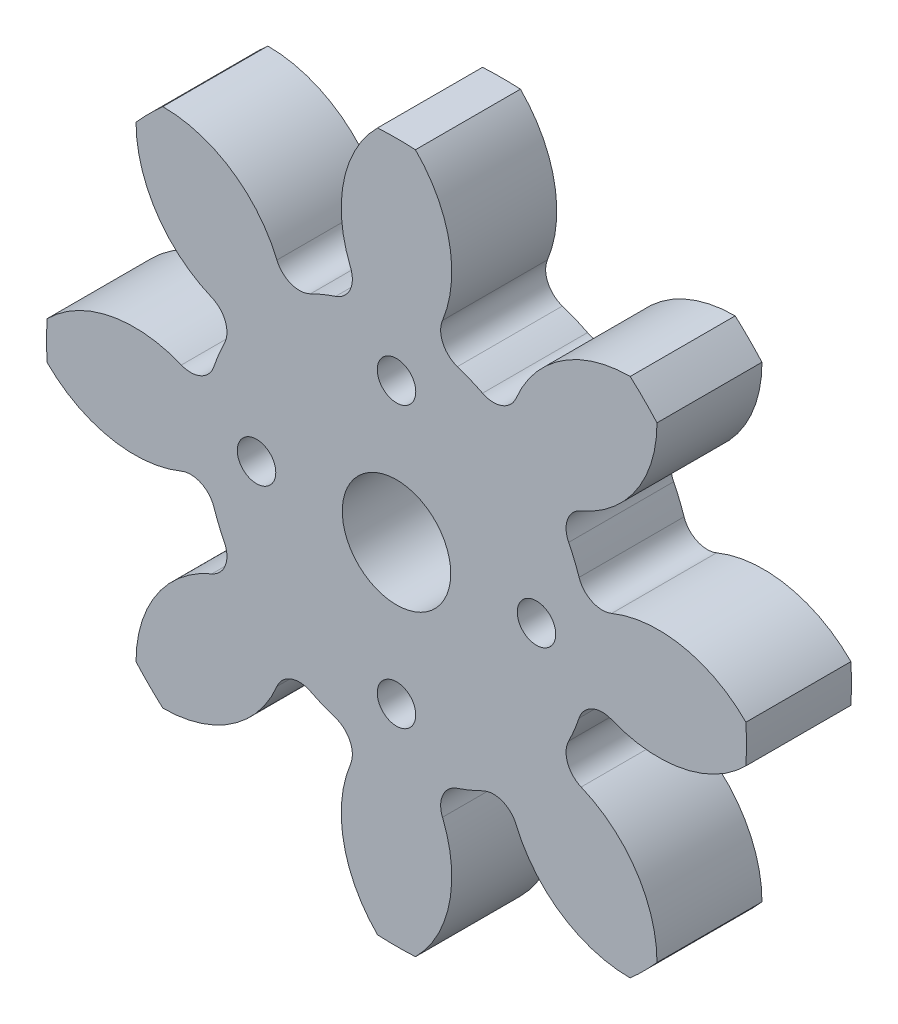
ISO-10303-21;
HEADER;
FILE_DESCRIPTION(('STEP AP214'),'2;1');
FILE_NAME('part.step','',(''),(''),'','','');
FILE_SCHEMA(('AUTOMOTIVE_DESIGN { 1 0 10303 214 1 1 1 1 }'));
ENDSEC;
DATA;
#1=APPLICATION_CONTEXT('core data for automotive mechanical design processes');
#2=APPLICATION_PROTOCOL_DEFINITION('international standard','automotive_design',2000,#1);
#3=PRODUCT_CONTEXT('',#1,'mechanical');
#4=PRODUCT('Part','Part','',(#3));
#5=PRODUCT_RELATED_PRODUCT_CATEGORY('part','',(#4));
#6=PRODUCT_DEFINITION_FORMATION('','',#4);
#7=PRODUCT_DEFINITION_CONTEXT('part definition',#1,'design');
#8=PRODUCT_DEFINITION('design','',#6,#7);
#9=PRODUCT_DEFINITION_SHAPE('','',#8);
#10=(LENGTH_UNIT() NAMED_UNIT(*) SI_UNIT(.MILLI.,.METRE.));
#11=(NAMED_UNIT(*) PLANE_ANGLE_UNIT() SI_UNIT($,.RADIAN.));
#12=(NAMED_UNIT(*) SI_UNIT($,.STERADIAN.) SOLID_ANGLE_UNIT());
#13=UNCERTAINTY_MEASURE_WITH_UNIT(LENGTH_MEASURE(1.E-05),#10,'distance_accuracy_value','');
#14=(GEOMETRIC_REPRESENTATION_CONTEXT(3) GLOBAL_UNCERTAINTY_ASSIGNED_CONTEXT((#13)) GLOBAL_UNIT_ASSIGNED_CONTEXT((#10,
#11,#12)) REPRESENTATION_CONTEXT('',''));
#15=CARTESIAN_POINT('',(0.,0.,0.));
#16=DIRECTION('',(0.,0.,1.));
#17=DIRECTION('',(1.,0.,0.));
#18=AXIS2_PLACEMENT_3D('',#15,#16,#17);
#19=CARTESIAN_POINT('',(0.,0.,6.));
#20=DIRECTION('',(0.,0.,-1.));
#21=DIRECTION('',(-1.,0.,0.));
#22=AXIS2_PLACEMENT_3D('',#19,#20,#21);
#23=CYLINDRICAL_SURFACE('',#22,11.);
#24=CARTESIAN_POINT('',(0.,0.,6.));
#25=DIRECTION('',(0.,0.,1.));
#26=DIRECTION('',(1.,0.,0.));
#27=AXIS2_PLACEMENT_3D('',#24,#25,#26);
#28=CIRCLE('',#27,11.);
#29=CARTESIAN_POINT('',(4.91765249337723,9.83954744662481,6.));
#30=VERTEX_POINT('',#29);
#31=CARTESIAN_POINT('',(3.48030529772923,10.4349161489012,6.));
#32=VERTEX_POINT('',#31);
#33=EDGE_CURVE('E530',#30,#32,#28,.T.);
#34=ORIENTED_EDGE('',*,*,#33,.F.);
#35=DIRECTION('',(0.,0.,-1.));
#36=VECTOR('',#35,1.);
#37=CARTESIAN_POINT('',(4.91765249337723,9.83954744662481,6.));
#38=LINE('',#37,#36);
#39=CARTESIAN_POINT('',(4.91765249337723,9.83954744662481,0.));
#40=VERTEX_POINT('',#39);
#41=EDGE_CURVE('E574',#30,#40,#38,.T.);
#42=ORIENTED_EDGE('',*,*,#41,.T.);
#43=CARTESIAN_POINT('',(0.,0.,0.));
#44=DIRECTION('',(0.,0.,1.));
#45=DIRECTION('',(1.,0.,0.));
#46=AXIS2_PLACEMENT_3D('',#43,#44,#45);
#47=CIRCLE('',#46,11.);
#48=CARTESIAN_POINT('',(3.48030529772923,10.4349161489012,0.));
#49=VERTEX_POINT('',#48);
#50=EDGE_CURVE('E518',#40,#49,#47,.T.);
#51=ORIENTED_EDGE('',*,*,#50,.T.);
#52=DIRECTION('',(0.,0.,-1.));
#53=VECTOR('',#52,1.);
#54=CARTESIAN_POINT('',(3.48030529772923,10.4349161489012,6.));
#55=LINE('',#54,#53);
#56=EDGE_CURVE('E550',#49,#32,#55,.F.);
#57=ORIENTED_EDGE('',*,*,#56,.T.);
#58=EDGE_LOOP('',(#34,#42,#51,#57));
#59=FACE_BOUND('',#58,.T.);
#60=ADVANCED_FACE('F28',(#59),#23,.T.);
#61=CARTESIAN_POINT('',(-3.88929784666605,14.9756297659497,6.));
#62=DIRECTION('',(0.,0.,-1.));
#63=DIRECTION('',(-1.,0.,0.));
#64=AXIS2_PLACEMENT_3D('',#61,#62,#63);
#65=CYLINDRICAL_SURFACE('',#64,7.04730535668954);
#66=CARTESIAN_POINT('',(-3.88929784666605,14.9756297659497,6.));
#67=DIRECTION('',(0.,0.,-1.));
#68=DIRECTION('',(-1.,0.,0.));
#69=AXIS2_PLACEMENT_3D('',#66,#67,#68);
#70=CIRCLE('',#69,7.04730535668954);
#71=CARTESIAN_POINT('',(1.08198717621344,19.9707111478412,6.));
#72=VERTEX_POINT('',#71);
#73=CARTESIAN_POINT('',(2.62845317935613,12.2954367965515,6.));
#74=VERTEX_POINT('',#73);
#75=EDGE_CURVE('E532',#72,#74,#70,.T.);
#76=ORIENTED_EDGE('',*,*,#75,.T.);
#77=DIRECTION('',(0.,0.,-1.));
#78=VECTOR('',#77,1.);
#79=CARTESIAN_POINT('',(2.62845317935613,12.2954367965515,6.));
#80=LINE('',#79,#78);
#81=CARTESIAN_POINT('',(2.62845317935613,12.2954367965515,0.));
#82=VERTEX_POINT('',#81);
#83=EDGE_CURVE('E547',#74,#82,#80,.T.);
#84=ORIENTED_EDGE('',*,*,#83,.T.);
#85=CARTESIAN_POINT('',(-3.88929784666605,14.9756297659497,0.));
#86=DIRECTION('',(0.,0.,-1.));
#87=DIRECTION('',(-1.,0.,0.));
#88=AXIS2_PLACEMENT_3D('',#85,#86,#87);
#89=CIRCLE('',#88,7.04730535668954);
#90=CARTESIAN_POINT('',(1.08198717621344,19.9707111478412,0.));
#91=VERTEX_POINT('',#90);
#92=EDGE_CURVE('E520',#91,#82,#89,.T.);
#93=ORIENTED_EDGE('',*,*,#92,.F.);
#94=DIRECTION('',(0.,0.,-1.));
#95=VECTOR('',#94,1.);
#96=CARTESIAN_POINT('',(1.08198717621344,19.9707111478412,6.));
#97=LINE('',#96,#95);
#98=EDGE_CURVE('E545',#72,#91,#97,.T.);
#99=ORIENTED_EDGE('',*,*,#98,.F.);
#100=EDGE_LOOP('',(#76,#84,#93,#99));
#101=FACE_BOUND('',#100,.T.);
#102=ADVANCED_FACE('F726',(#101),#65,.T.);
#103=CARTESIAN_POINT('',(0.,0.,6.));
#104=DIRECTION('',(0.,0.,-1.));
#105=DIRECTION('',(-1.,0.,0.));
#106=AXIS2_PLACEMENT_3D('',#103,#104,#105);
#107=CYLINDRICAL_SURFACE('',#106,20.);
#108=CARTESIAN_POINT('',(0.,0.,0.));
#109=DIRECTION('',(0.,0.,1.));
#110=DIRECTION('',(1.,0.,0.));
#111=AXIS2_PLACEMENT_3D('',#108,#109,#110);
#112=CIRCLE('',#111,20.);
#113=CARTESIAN_POINT('',(-1.08198717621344,19.9707111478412,0.));
#114=VERTEX_POINT('',#113);
#115=EDGE_CURVE('E523',#91,#114,#112,.T.);
#116=ORIENTED_EDGE('',*,*,#115,.T.);
#117=DIRECTION('',(0.,0.,-1.));
#118=VECTOR('',#117,1.);
#119=CARTESIAN_POINT('',(-1.08198717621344,19.9707111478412,6.));
#120=LINE('',#119,#118);
#121=CARTESIAN_POINT('',(-1.08198717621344,19.9707111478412,6.));
#122=VERTEX_POINT('',#121);
#123=EDGE_CURVE('E542',#122,#114,#120,.T.);
#124=ORIENTED_EDGE('',*,*,#123,.F.);
#125=CARTESIAN_POINT('',(0.,0.,6.));
#126=DIRECTION('',(0.,0.,1.));
#127=DIRECTION('',(1.,0.,0.));
#128=AXIS2_PLACEMENT_3D('',#125,#126,#127);
#129=CIRCLE('',#128,20.);
#130=EDGE_CURVE('E535',#72,#122,#129,.T.);
#131=ORIENTED_EDGE('',*,*,#130,.F.);
#132=ORIENTED_EDGE('',*,*,#98,.T.);
#133=EDGE_LOOP('',(#116,#124,#131,#132));
#134=FACE_BOUND('',#133,.T.);
#135=ADVANCED_FACE('F722',(#134),#107,.T.);
#136=CARTESIAN_POINT('',(3.88929784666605,14.9756297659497,6.));
#137=DIRECTION('',(0.,0.,-1.));
#138=DIRECTION('',(-1.,0.,0.));
#139=AXIS2_PLACEMENT_3D('',#136,#137,#138);
#140=CYLINDRICAL_SURFACE('',#139,7.04730535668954);
#141=CARTESIAN_POINT('',(3.88929784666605,14.9756297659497,0.));
#142=DIRECTION('',(0.,0.,1.));
#143=DIRECTION('',(1.,0.,0.));
#144=AXIS2_PLACEMENT_3D('',#141,#142,#143);
#145=CIRCLE('',#144,7.04730535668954);
#146=CARTESIAN_POINT('',(-2.62845317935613,12.2954367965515,0.));
#147=VERTEX_POINT('',#146);
#148=EDGE_CURVE('E525',#114,#147,#145,.T.);
#149=ORIENTED_EDGE('',*,*,#148,.T.);
#150=DIRECTION('',(0.,0.,-1.));
#151=VECTOR('',#150,1.);
#152=CARTESIAN_POINT('',(-2.62845317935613,12.2954367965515,6.));
#153=LINE('',#152,#151);
#154=CARTESIAN_POINT('',(-2.62845317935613,12.2954367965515,6.));
#155=VERTEX_POINT('',#154);
#156=EDGE_CURVE('E556',#147,#155,#153,.F.);
#157=ORIENTED_EDGE('',*,*,#156,.T.);
#158=CARTESIAN_POINT('',(3.88929784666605,14.9756297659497,6.));
#159=DIRECTION('',(0.,0.,1.));
#160=DIRECTION('',(1.,0.,0.));
#161=AXIS2_PLACEMENT_3D('',#158,#159,#160);
#162=CIRCLE('',#161,7.04730535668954);
#163=EDGE_CURVE('E537',#122,#155,#162,.T.);
#164=ORIENTED_EDGE('',*,*,#163,.F.);
#165=ORIENTED_EDGE('',*,*,#123,.T.);
#166=EDGE_LOOP('',(#149,#157,#164,#165));
#167=FACE_BOUND('',#166,.T.);
#168=ADVANCED_FACE('F717',(#167),#140,.T.);
#169=CARTESIAN_POINT('',(0.,0.,6.));
#170=DIRECTION('',(0.,0.,-1.));
#171=DIRECTION('',(-1.,0.,0.));
#172=AXIS2_PLACEMENT_3D('',#169,#170,#171);
#173=CYLINDRICAL_SURFACE('',#172,11.);
#174=CARTESIAN_POINT('',(0.,0.,0.));
#175=DIRECTION('',(0.,0.,-1.));
#176=DIRECTION('',(-1.,0.,0.));
#177=AXIS2_PLACEMENT_3D('',#174,#175,#176);
#178=CIRCLE('',#177,11.);
#179=CARTESIAN_POINT('',(-4.91765249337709,9.83954744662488,0.));
#180=VERTEX_POINT('',#179);
#181=CARTESIAN_POINT('',(-3.48030529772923,10.4349161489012,0.));
#182=VERTEX_POINT('',#181);
#183=EDGE_CURVE('E528',#180,#182,#178,.T.);
#184=ORIENTED_EDGE('',*,*,#183,.F.);
#185=DIRECTION('',(0.,0.,-1.));
#186=VECTOR('',#185,1.);
#187=CARTESIAN_POINT('',(-4.91765249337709,9.83954744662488,6.));
#188=LINE('',#187,#186);
#189=CARTESIAN_POINT('',(-4.91765249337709,9.83954744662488,6.));
#190=VERTEX_POINT('',#189);
#191=EDGE_CURVE('E689',#180,#190,#188,.F.);
#192=ORIENTED_EDGE('',*,*,#191,.T.);
#193=CARTESIAN_POINT('',(0.,0.,6.));
#194=DIRECTION('',(0.,0.,-1.));
#195=DIRECTION('',(-1.,0.,0.));
#196=AXIS2_PLACEMENT_3D('',#193,#194,#195);
#197=CIRCLE('',#196,11.);
#198=CARTESIAN_POINT('',(-3.48030529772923,10.4349161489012,6.));
#199=VERTEX_POINT('',#198);
#200=EDGE_CURVE('E540',#190,#199,#197,.T.);
#201=ORIENTED_EDGE('',*,*,#200,.T.);
#202=DIRECTION('',(0.,0.,-1.));
#203=VECTOR('',#202,1.);
#204=CARTESIAN_POINT('',(-3.48030529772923,10.4349161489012,6.));
#205=LINE('',#204,#203);
#206=EDGE_CURVE('E553',#199,#182,#205,.T.);
#207=ORIENTED_EDGE('',*,*,#206,.T.);
#208=EDGE_LOOP('',(#184,#192,#201,#207));
#209=FACE_BOUND('',#208,.T.);
#210=ADVANCED_FACE('F708',(#209),#173,.T.);
#211=CARTESIAN_POINT('',(0.,0.,6.));
#212=DIRECTION('',(0.,0.,1.));
#213=DIRECTION('',(1.,0.,0.));
#214=AXIS2_PLACEMENT_3D('',#211,#212,#213);
#215=PLANE('',#214);
#216=CARTESIAN_POINT('',(8.,0.,6.));
#217=DIRECTION('',(0.,0.,1.));
#218=DIRECTION('',(1.,0.,0.));
#219=AXIS2_PLACEMENT_3D('',#216,#217,#218);
#220=CIRCLE('',#219,1.1);
#221=CARTESIAN_POINT('',(9.1,0.,6.));
#222=VERTEX_POINT('',#221);
#223=EDGE_CURVE('E1150',#222,#222,#220,.T.);
#224=ORIENTED_EDGE('',*,*,#223,.F.);
#225=EDGE_LOOP('',(#224));
#226=FACE_BOUND('',#225,.T.);
#227=CARTESIAN_POINT('',(0.,-8.,6.));
#228=DIRECTION('',(0.,0.,1.));
#229=DIRECTION('',(1.,0.,0.));
#230=AXIS2_PLACEMENT_3D('',#227,#228,#229);
#231=CIRCLE('',#230,1.1);
#232=CARTESIAN_POINT('',(1.10000000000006,-8.,6.));
#233=VERTEX_POINT('',#232);
#234=EDGE_CURVE('E1149',#233,#233,#231,.T.);
#235=ORIENTED_EDGE('',*,*,#234,.F.);
#236=EDGE_LOOP('',(#235));
#237=FACE_BOUND('',#236,.T.);
#238=CARTESIAN_POINT('',(-8.,0.,6.));
#239=DIRECTION('',(0.,0.,1.));
#240=DIRECTION('',(1.,0.,0.));
#241=AXIS2_PLACEMENT_3D('',#238,#239,#240);
#242=CIRCLE('',#241,1.1);
#243=CARTESIAN_POINT('',(-6.9,0.,6.));
#244=VERTEX_POINT('',#243);
#245=EDGE_CURVE('E1160',#244,#244,#242,.T.);
#246=ORIENTED_EDGE('',*,*,#245,.F.);
#247=EDGE_LOOP('',(#246));
#248=FACE_BOUND('',#247,.T.);
#249=CARTESIAN_POINT('',(0.,8.,6.));
#250=DIRECTION('',(0.,0.,1.));
#251=DIRECTION('',(1.,0.,0.));
#252=AXIS2_PLACEMENT_3D('',#249,#250,#251);
#253=CIRCLE('',#252,1.1);
#254=CARTESIAN_POINT('',(1.1,8.,6.));
#255=VERTEX_POINT('',#254);
#256=EDGE_CURVE('E1166',#255,#255,#253,.T.);
#257=ORIENTED_EDGE('',*,*,#256,.F.);
#258=EDGE_LOOP('',(#257));
#259=FACE_BOUND('',#258,.T.);
#260=CARTESIAN_POINT('',(0.,0.,6.));
#261=DIRECTION('',(0.,0.,1.));
#262=DIRECTION('',(1.,0.,0.));
#263=AXIS2_PLACEMENT_3D('',#260,#261,#262);
#264=CIRCLE('',#263,3.1);
#265=CARTESIAN_POINT('',(3.1,0.,6.));
#266=VERTEX_POINT('',#265);
#267=EDGE_CURVE('E358',#266,#266,#264,.T.);
#268=ORIENTED_EDGE('',*,*,#267,.F.);
#269=EDGE_LOOP('',(#268));
#270=FACE_BOUND('',#269,.T.);
#271=CARTESIAN_POINT('',(13.339518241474,7.83922047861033,6.));
#272=DIRECTION('',(0.,0.,1.));
#273=DIRECTION('',(0.707106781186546,-0.707106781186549,0.));
#274=AXIS2_PLACEMENT_3D('',#271,#272,#273);
#275=CIRCLE('',#274,7.04730535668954);
#276=CARTESIAN_POINT('',(13.3563448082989,14.8865057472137,6.));
#277=VERTEX_POINT('',#276);
#278=CARTESIAN_POINT('',(6.8355896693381,10.5527838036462,6.));
#279=VERTEX_POINT('',#278);
#280=EDGE_CURVE('E510',#277,#279,#275,.T.);
#281=ORIENTED_EDGE('',*,*,#280,.T.);
#282=CARTESIAN_POINT('',(5.54353553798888,11.0918534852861,6.));
#283=DIRECTION('',(0.,0.,1.));
#284=DIRECTION('',(1.,0.,0.));
#285=AXIS2_PLACEMENT_3D('',#282,#283,#284);
#286=CIRCLE('',#285,1.4);
#287=EDGE_CURVE('E586',#279,#30,#286,.F.);
#288=ORIENTED_EDGE('',*,*,#287,.T.);
#289=ORIENTED_EDGE('',*,*,#33,.T.);
#290=CARTESIAN_POINT('',(3.92325324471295,11.762996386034,6.));
#291=DIRECTION('',(0.,0.,1.));
#292=DIRECTION('',(1.,0.,0.));
#293=AXIS2_PLACEMENT_3D('',#290,#291,#292);
#294=CIRCLE('',#293,1.4);
#295=EDGE_CURVE('E561',#32,#74,#294,.F.);
#296=ORIENTED_EDGE('',*,*,#295,.T.);
#297=ORIENTED_EDGE('',*,*,#75,.F.);
#298=ORIENTED_EDGE('',*,*,#130,.T.);
#299=ORIENTED_EDGE('',*,*,#163,.T.);
#300=CARTESIAN_POINT('',(-3.92325324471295,11.762996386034,6.));
#301=DIRECTION('',(0.,0.,1.));
#302=DIRECTION('',(1.,0.,0.));
#303=AXIS2_PLACEMENT_3D('',#300,#301,#302);
#304=CIRCLE('',#303,1.4);
#305=EDGE_CURVE('E565',#155,#199,#304,.F.);
#306=ORIENTED_EDGE('',*,*,#305,.T.);
#307=ORIENTED_EDGE('',*,*,#200,.F.);
#308=CARTESIAN_POINT('',(-5.54353553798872,11.0918534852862,6.));
#309=DIRECTION('',(0.,0.,1.));
#310=DIRECTION('',(1.,0.,0.));
#311=AXIS2_PLACEMENT_3D('',#308,#309,#310);
#312=CIRCLE('',#311,1.4);
#313=CARTESIAN_POINT('',(-6.83558966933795,10.5527838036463,6.));
#314=VERTEX_POINT('',#313);
#315=EDGE_CURVE('E697',#190,#314,#312,.F.);
#316=ORIENTED_EDGE('',*,*,#315,.T.);
#317=CARTESIAN_POINT('',(-13.3395182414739,7.83922047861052,6.));
#318=DIRECTION('',(0.,0.,-1.));
#319=DIRECTION('',(-0.707106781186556,-0.707106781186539,0.));
#320=AXIS2_PLACEMENT_3D('',#317,#318,#319);
#321=CIRCLE('',#320,7.04730535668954);
#322=CARTESIAN_POINT('',(-13.3563448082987,14.8865057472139,6.));
#323=VERTEX_POINT('',#322);
#324=EDGE_CURVE('E363',#323,#314,#321,.T.);
#325=ORIENTED_EDGE('',*,*,#324,.F.);
#326=CARTESIAN_POINT('',(0.,0.,6.));
#327=DIRECTION('',(0.,0.,1.));
#328=DIRECTION('',(0.707106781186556,0.707106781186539,0.));
#329=AXIS2_PLACEMENT_3D('',#326,#327,#328);
#330=CIRCLE('',#329,20.);
#331=CARTESIAN_POINT('',(-14.8865057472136,13.3563448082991,6.));
#332=VERTEX_POINT('',#331);
#333=EDGE_CURVE('E337',#323,#332,#330,.T.);
#334=ORIENTED_EDGE('',*,*,#333,.T.);
#335=CARTESIAN_POINT('',(-7.83922047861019,13.3395182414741,6.));
#336=DIRECTION('',(0.,0.,1.));
#337=DIRECTION('',(0.707106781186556,0.707106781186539,0.));
#338=AXIS2_PLACEMENT_3D('',#335,#336,#337);
#339=CIRCLE('',#338,7.04730535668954);
#340=CARTESIAN_POINT('',(-10.5527838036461,6.83558966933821,6.));
#341=VERTEX_POINT('',#340);
#342=EDGE_CURVE('E366',#332,#341,#339,.T.);
#343=ORIENTED_EDGE('',*,*,#342,.T.);
#344=CARTESIAN_POINT('',(-11.0918534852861,5.54353553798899,6.));
#345=DIRECTION('',(0.,0.,1.));
#346=DIRECTION('',(1.,0.,0.));
#347=AXIS2_PLACEMENT_3D('',#344,#345,#346);
#348=CIRCLE('',#347,1.4);
#349=CARTESIAN_POINT('',(-9.83954744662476,4.91765249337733,6.));
#350=VERTEX_POINT('',#349);
#351=EDGE_CURVE('E11',#341,#350,#348,.F.);
#352=ORIENTED_EDGE('',*,*,#351,.T.);
#353=CARTESIAN_POINT('',(0.,0.,6.));
#354=DIRECTION('',(0.,0.,1.));
#355=DIRECTION('',(0.,1.,0.));
#356=AXIS2_PLACEMENT_3D('',#353,#354,#355);
#357=CIRCLE('',#356,11.);
#358=CARTESIAN_POINT('',(-10.4349161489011,3.48030529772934,6.));
#359=VERTEX_POINT('',#358);
#360=EDGE_CURVE('E378',#350,#359,#357,.T.);
#361=ORIENTED_EDGE('',*,*,#360,.T.);
#362=CARTESIAN_POINT('',(-11.762996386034,3.92325324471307,6.));
#363=DIRECTION('',(0.,0.,1.));
#364=DIRECTION('',(1.,0.,0.));
#365=AXIS2_PLACEMENT_3D('',#362,#363,#364);
#366=CIRCLE('',#365,1.4);
#367=CARTESIAN_POINT('',(-12.2954367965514,2.62845317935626,6.));
#368=VERTEX_POINT('',#367);
#369=EDGE_CURVE('E682',#359,#368,#366,.F.);
#370=ORIENTED_EDGE('',*,*,#369,.T.);
#371=CARTESIAN_POINT('',(-14.9756297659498,-3.8892978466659,6.));
#372=DIRECTION('',(0.,0.,-1.));
#373=DIRECTION('',(0.,-1.,0.));
#374=AXIS2_PLACEMENT_3D('',#371,#372,#373);
#375=CIRCLE('',#374,7.04730535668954);
#376=CARTESIAN_POINT('',(-19.9707111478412,1.08198717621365,6.));
#377=VERTEX_POINT('',#376);
#378=EDGE_CURVE('E380',#377,#368,#375,.T.);
#379=ORIENTED_EDGE('',*,*,#378,.F.);
#380=CARTESIAN_POINT('',(0.,0.,6.));
#381=DIRECTION('',(0.,0.,1.));
#382=DIRECTION('',(0.,1.,0.));
#383=AXIS2_PLACEMENT_3D('',#380,#381,#382);
#384=CIRCLE('',#383,20.);
#385=CARTESIAN_POINT('',(-19.9707111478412,-1.08198717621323,6.));
#386=VERTEX_POINT('',#385);
#387=EDGE_CURVE('E383',#377,#386,#384,.T.);
#388=ORIENTED_EDGE('',*,*,#387,.T.);
#389=CARTESIAN_POINT('',(-14.9756297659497,3.88929784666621,6.));
#390=DIRECTION('',(0.,0.,1.));
#391=DIRECTION('',(0.,1.,0.));
#392=AXIS2_PLACEMENT_3D('',#389,#390,#391);
#393=CIRCLE('',#392,7.04730535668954);
#394=CARTESIAN_POINT('',(-12.2954367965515,-2.628453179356,6.));
#395=VERTEX_POINT('',#394);
#396=EDGE_CURVE('E385',#386,#395,#393,.T.);
#397=ORIENTED_EDGE('',*,*,#396,.T.);
#398=CARTESIAN_POINT('',(-11.7629963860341,-3.92325324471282,6.));
#399=DIRECTION('',(0.,0.,1.));
#400=DIRECTION('',(1.,0.,0.));
#401=AXIS2_PLACEMENT_3D('',#398,#399,#400);
#402=CIRCLE('',#401,1.4);
#403=CARTESIAN_POINT('',(-10.4349161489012,-3.48030529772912,6.));
#404=VERTEX_POINT('',#403);
#405=EDGE_CURVE('E686',#395,#404,#402,.F.);
#406=ORIENTED_EDGE('',*,*,#405,.T.);
#407=CARTESIAN_POINT('',(0.,0.,6.));
#408=DIRECTION('',(0.,0.,1.));
#409=DIRECTION('',(-0.707106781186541,0.707106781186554,0.));
#410=AXIS2_PLACEMENT_3D('',#407,#408,#409);
#411=CIRCLE('',#410,11.);
#412=CARTESIAN_POINT('',(-9.83954744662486,-4.91765249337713,6.));
#413=VERTEX_POINT('',#412);
#414=EDGE_CURVE('E403',#404,#413,#411,.T.);
#415=ORIENTED_EDGE('',*,*,#414,.T.);
#416=CARTESIAN_POINT('',(-11.0918534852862,-5.54353553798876,6.));
#417=DIRECTION('',(0.,0.,1.));
#418=DIRECTION('',(1.,0.,0.));
#419=AXIS2_PLACEMENT_3D('',#416,#417,#418);
#420=CIRCLE('',#419,1.4);
#421=CARTESIAN_POINT('',(-10.5527838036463,-6.83558966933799,6.));
#422=VERTEX_POINT('',#421);
#423=EDGE_CURVE('E662',#413,#422,#420,.F.);
#424=ORIENTED_EDGE('',*,*,#423,.T.);
#425=CARTESIAN_POINT('',(-7.83922047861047,-13.3395182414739,6.));
#426=DIRECTION('',(0.,0.,-1.));
#427=DIRECTION('',(0.707106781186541,-0.707106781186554,0.));
#428=AXIS2_PLACEMENT_3D('',#425,#426,#427);
#429=CIRCLE('',#428,7.04730535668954);
#430=CARTESIAN_POINT('',(-14.8865057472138,-13.3563448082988,6.));
#431=VERTEX_POINT('',#430);
#432=EDGE_CURVE('E405',#431,#422,#429,.T.);
#433=ORIENTED_EDGE('',*,*,#432,.F.);
#434=CARTESIAN_POINT('',(0.,0.,6.));
#435=DIRECTION('',(0.,0.,1.));
#436=DIRECTION('',(-0.707106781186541,0.707106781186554,0.));
#437=AXIS2_PLACEMENT_3D('',#434,#435,#436);
#438=CIRCLE('',#437,20.);
#439=CARTESIAN_POINT('',(-13.356344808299,-14.8865057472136,6.));
#440=VERTEX_POINT('',#439);
#441=EDGE_CURVE('E408',#431,#440,#438,.T.);
#442=ORIENTED_EDGE('',*,*,#441,.T.);
#443=CARTESIAN_POINT('',(-13.339518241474,-7.83922047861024,6.));
#444=DIRECTION('',(0.,0.,1.));
#445=DIRECTION('',(-0.707106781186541,0.707106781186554,0.));
#446=AXIS2_PLACEMENT_3D('',#443,#444,#445);
#447=CIRCLE('',#446,7.04730535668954);
#448=CARTESIAN_POINT('',(-6.83558966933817,-10.5527838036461,6.));
#449=VERTEX_POINT('',#448);
#450=EDGE_CURVE('E410',#440,#449,#447,.T.);
#451=ORIENTED_EDGE('',*,*,#450,.T.);
#452=CARTESIAN_POINT('',(-5.54353553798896,-11.0918534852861,6.));
#453=DIRECTION('',(0.,0.,1.));
#454=DIRECTION('',(1.,0.,0.));
#455=AXIS2_PLACEMENT_3D('',#452,#453,#454);
#456=CIRCLE('',#455,1.4);
#457=CARTESIAN_POINT('',(-4.9176524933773,-9.83954744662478,6.));
#458=VERTEX_POINT('',#457);
#459=EDGE_CURVE('E666',#449,#458,#456,.F.);
#460=ORIENTED_EDGE('',*,*,#459,.T.);
#461=CARTESIAN_POINT('',(0.,0.,6.));
#462=DIRECTION('',(0.,0.,1.));
#463=DIRECTION('',(-1.,0.,0.));
#464=AXIS2_PLACEMENT_3D('',#461,#462,#463);
#465=CIRCLE('',#464,11.);
#466=CARTESIAN_POINT('',(-3.4803052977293,-10.4349161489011,6.));
#467=VERTEX_POINT('',#466);
#468=EDGE_CURVE('E428',#458,#467,#465,.T.);
#469=ORIENTED_EDGE('',*,*,#468,.T.);
#470=CARTESIAN_POINT('',(-3.92325324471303,-11.762996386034,6.));
#471=DIRECTION('',(0.,0.,1.));
#472=DIRECTION('',(1.,0.,0.));
#473=AXIS2_PLACEMENT_3D('',#470,#471,#472);
#474=CIRCLE('',#473,1.4);
#475=CARTESIAN_POINT('',(-2.62845317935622,-12.2954367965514,6.));
#476=VERTEX_POINT('',#475);
#477=EDGE_CURVE('E642',#467,#476,#474,.F.);
#478=ORIENTED_EDGE('',*,*,#477,.T.);
#479=CARTESIAN_POINT('',(3.88929784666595,-14.9756297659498,6.));
#480=DIRECTION('',(0.,0.,-1.));
#481=DIRECTION('',(1.,0.,0.));
#482=AXIS2_PLACEMENT_3D('',#479,#480,#481);
#483=CIRCLE('',#482,7.04730535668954);
#484=CARTESIAN_POINT('',(-1.08198717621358,-19.9707111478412,6.));
#485=VERTEX_POINT('',#484);
#486=EDGE_CURVE('E430',#485,#476,#483,.T.);
#487=ORIENTED_EDGE('',*,*,#486,.F.);
#488=CARTESIAN_POINT('',(0.,0.,6.));
#489=DIRECTION('',(0.,0.,1.));
#490=DIRECTION('',(-1.,0.,0.));
#491=AXIS2_PLACEMENT_3D('',#488,#489,#490);
#492=CIRCLE('',#491,20.);
#493=CARTESIAN_POINT('',(1.0819871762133,-19.9707111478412,6.));
#494=VERTEX_POINT('',#493);
#495=EDGE_CURVE('E433',#485,#494,#492,.T.);
#496=ORIENTED_EDGE('',*,*,#495,.T.);
#497=CARTESIAN_POINT('',(-3.88929784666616,-14.9756297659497,6.));
#498=DIRECTION('',(0.,0.,1.));
#499=DIRECTION('',(-1.,0.,0.));
#500=AXIS2_PLACEMENT_3D('',#497,#498,#499);
#501=CIRCLE('',#500,7.04730535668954);
#502=CARTESIAN_POINT('',(2.62845317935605,-12.2954367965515,6.));
#503=VERTEX_POINT('',#502);
#504=EDGE_CURVE('E435',#494,#503,#501,.T.);
#505=ORIENTED_EDGE('',*,*,#504,.T.);
#506=CARTESIAN_POINT('',(3.92325324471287,-11.7629963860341,6.));
#507=DIRECTION('',(0.,0.,1.));
#508=DIRECTION('',(1.,0.,0.));
#509=AXIS2_PLACEMENT_3D('',#506,#507,#508);
#510=CIRCLE('',#509,1.4);
#511=CARTESIAN_POINT('',(3.48030529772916,-10.4349161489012,6.));
#512=VERTEX_POINT('',#511);
#513=EDGE_CURVE('E646',#503,#512,#510,.F.);
#514=ORIENTED_EDGE('',*,*,#513,.T.);
#515=CARTESIAN_POINT('',(0.,0.,6.));
#516=DIRECTION('',(0.,0.,1.));
#517=DIRECTION('',(-0.707106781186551,-0.707106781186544,0.));
#518=AXIS2_PLACEMENT_3D('',#515,#516,#517);
#519=CIRCLE('',#518,11.);
#520=CARTESIAN_POINT('',(4.91765249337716,-9.83954744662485,6.));
#521=VERTEX_POINT('',#520);
#522=EDGE_CURVE('E453',#512,#521,#519,.T.);
#523=ORIENTED_EDGE('',*,*,#522,.T.);
#524=CARTESIAN_POINT('',(5.5435355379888,-11.0918534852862,6.));
#525=DIRECTION('',(0.,0.,1.));
#526=DIRECTION('',(1.,0.,0.));
#527=AXIS2_PLACEMENT_3D('',#524,#525,#526);
#528=CIRCLE('',#527,1.4);
#529=CARTESIAN_POINT('',(6.83558966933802,-10.5527838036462,6.));
#530=VERTEX_POINT('',#529);
#531=EDGE_CURVE('E622',#521,#530,#528,.F.);
#532=ORIENTED_EDGE('',*,*,#531,.T.);
#533=CARTESIAN_POINT('',(13.3395182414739,-7.83922047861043,6.));
#534=DIRECTION('',(0.,0.,-1.));
#535=DIRECTION('',(0.707106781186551,0.707106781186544,0.));
#536=AXIS2_PLACEMENT_3D('',#533,#534,#535);
#537=CIRCLE('',#536,7.04730535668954);
#538=CARTESIAN_POINT('',(13.3563448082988,-14.8865057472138,6.));
#539=VERTEX_POINT('',#538);
#540=EDGE_CURVE('E455',#539,#530,#537,.T.);
#541=ORIENTED_EDGE('',*,*,#540,.F.);
#542=CARTESIAN_POINT('',(0.,0.,6.));
#543=DIRECTION('',(0.,0.,1.));
#544=DIRECTION('',(-0.707106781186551,-0.707106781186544,0.));
#545=AXIS2_PLACEMENT_3D('',#542,#543,#544);
#546=CIRCLE('',#545,20.);
#547=CARTESIAN_POINT('',(14.8865057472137,-13.356344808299,6.));
#548=VERTEX_POINT('',#547);
#549=EDGE_CURVE('E458',#539,#548,#546,.T.);
#550=ORIENTED_EDGE('',*,*,#549,.T.);
#551=CARTESIAN_POINT('',(7.83922047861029,-13.339518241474,6.));
#552=DIRECTION('',(0.,0.,1.));
#553=DIRECTION('',(-0.707106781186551,-0.707106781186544,0.));
#554=AXIS2_PLACEMENT_3D('',#551,#552,#553);
#555=CIRCLE('',#554,7.04730535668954);
#556=CARTESIAN_POINT('',(10.5527838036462,-6.83558966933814,6.));
#557=VERTEX_POINT('',#556);
#558=EDGE_CURVE('E460',#548,#557,#555,.T.);
#559=ORIENTED_EDGE('',*,*,#558,.T.);
#560=CARTESIAN_POINT('',(11.0918534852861,-5.54353553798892,6.));
#561=DIRECTION('',(0.,0.,1.));
#562=DIRECTION('',(1.,0.,0.));
#563=AXIS2_PLACEMENT_3D('',#560,#561,#562);
#564=CIRCLE('',#563,1.4);
#565=CARTESIAN_POINT('',(9.83954744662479,-4.91765249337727,6.));
#566=VERTEX_POINT('',#565);
#567=EDGE_CURVE('E626',#557,#566,#564,.F.);
#568=ORIENTED_EDGE('',*,*,#567,.T.);
#569=CARTESIAN_POINT('',(0.,0.,6.));
#570=DIRECTION('',(0.,0.,1.));
#571=DIRECTION('',(0.,-1.,0.));
#572=AXIS2_PLACEMENT_3D('',#569,#570,#571);
#573=CIRCLE('',#572,11.);
#574=CARTESIAN_POINT('',(10.4349161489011,-3.48030529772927,6.));
#575=VERTEX_POINT('',#574);
#576=EDGE_CURVE('E478',#566,#575,#573,.T.);
#577=ORIENTED_EDGE('',*,*,#576,.T.);
#578=CARTESIAN_POINT('',(11.762996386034,-3.92325324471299,6.));
#579=DIRECTION('',(0.,0.,1.));
#580=DIRECTION('',(1.,0.,0.));
#581=AXIS2_PLACEMENT_3D('',#578,#579,#580);
#582=CIRCLE('',#581,1.4);
#583=CARTESIAN_POINT('',(12.2954367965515,-2.62845317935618,6.));
#584=VERTEX_POINT('',#583);
#585=EDGE_CURVE('E602',#575,#584,#582,.F.);
#586=ORIENTED_EDGE('',*,*,#585,.T.);
#587=CARTESIAN_POINT('',(14.9756297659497,3.889297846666,6.));
#588=DIRECTION('',(0.,0.,-1.));
#589=DIRECTION('',(0.,1.,0.));
#590=AXIS2_PLACEMENT_3D('',#587,#588,#589);
#591=CIRCLE('',#590,7.04730535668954);
#592=CARTESIAN_POINT('',(19.9707111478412,-1.08198717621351,6.));
#593=VERTEX_POINT('',#592);
#594=EDGE_CURVE('E480',#593,#584,#591,.T.);
#595=ORIENTED_EDGE('',*,*,#594,.F.);
#596=CARTESIAN_POINT('',(0.,0.,6.));
#597=DIRECTION('',(0.,0.,1.));
#598=DIRECTION('',(0.,-1.,0.));
#599=AXIS2_PLACEMENT_3D('',#596,#597,#598);
#600=CIRCLE('',#599,20.);
#601=CARTESIAN_POINT('',(19.9707111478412,1.08198717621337,6.));
#602=VERTEX_POINT('',#601);
#603=EDGE_CURVE('E483',#593,#602,#600,.T.);
#604=ORIENTED_EDGE('',*,*,#603,.T.);
#605=CARTESIAN_POINT('',(14.9756297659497,-3.88929784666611,6.));
#606=DIRECTION('',(0.,0.,1.));
#607=DIRECTION('',(0.,-1.,0.));
#608=AXIS2_PLACEMENT_3D('',#605,#606,#607);
#609=CIRCLE('',#608,7.04730535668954);
#610=CARTESIAN_POINT('',(12.2954367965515,2.62845317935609,6.));
#611=VERTEX_POINT('',#610);
#612=EDGE_CURVE('E485',#602,#611,#609,.T.);
#613=ORIENTED_EDGE('',*,*,#612,.T.);
#614=CARTESIAN_POINT('',(11.762996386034,3.92325324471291,6.));
#615=DIRECTION('',(0.,0.,1.));
#616=DIRECTION('',(1.,0.,0.));
#617=AXIS2_PLACEMENT_3D('',#614,#615,#616);
#618=CIRCLE('',#617,1.4);
#619=CARTESIAN_POINT('',(10.4349161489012,3.48030529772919,6.));
#620=VERTEX_POINT('',#619);
#621=EDGE_CURVE('E606',#611,#620,#618,.F.);
#622=ORIENTED_EDGE('',*,*,#621,.T.);
#623=CARTESIAN_POINT('',(0.,0.,6.));
#624=DIRECTION('',(0.,0.,1.));
#625=DIRECTION('',(0.707106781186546,-0.707106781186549,0.));
#626=AXIS2_PLACEMENT_3D('',#623,#624,#625);
#627=CIRCLE('',#626,11.);
#628=CARTESIAN_POINT('',(9.83954744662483,4.91765249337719,6.));
#629=VERTEX_POINT('',#628);
#630=EDGE_CURVE('E503',#620,#629,#627,.T.);
#631=ORIENTED_EDGE('',*,*,#630,.T.);
#632=CARTESIAN_POINT('',(11.0918534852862,5.54353553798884,6.));
#633=DIRECTION('',(0.,0.,1.));
#634=DIRECTION('',(1.,0.,0.));
#635=AXIS2_PLACEMENT_3D('',#632,#633,#634);
#636=CIRCLE('',#635,1.4);
#637=CARTESIAN_POINT('',(10.5527838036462,6.83558966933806,6.));
#638=VERTEX_POINT('',#637);
#639=EDGE_CURVE('E582',#629,#638,#636,.F.);
#640=ORIENTED_EDGE('',*,*,#639,.T.);
#641=CARTESIAN_POINT('',(7.83922047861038,13.3395182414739,6.));
#642=DIRECTION('',(0.,0.,-1.));
#643=DIRECTION('',(-0.707106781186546,0.707106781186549,0.));
#644=AXIS2_PLACEMENT_3D('',#641,#642,#643);
#645=CIRCLE('',#644,7.04730535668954);
#646=CARTESIAN_POINT('',(14.8865057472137,13.3563448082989,6.));
#647=VERTEX_POINT('',#646);
#648=EDGE_CURVE('E505',#647,#638,#645,.T.);
#649=ORIENTED_EDGE('',*,*,#648,.F.);
#650=CARTESIAN_POINT('',(0.,0.,6.));
#651=DIRECTION('',(0.,0.,1.));
#652=DIRECTION('',(0.707106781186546,-0.707106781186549,0.));
#653=AXIS2_PLACEMENT_3D('',#650,#651,#652);
#654=CIRCLE('',#653,20.);
#655=EDGE_CURVE('E508',#647,#277,#654,.T.);
#656=ORIENTED_EDGE('',*,*,#655,.T.);
#657=EDGE_LOOP('',(#281,#288,#289,#296,#297,#298,#299,#306,#307,#316,#325,#334,#343,#352,#361,
#370,#379,#388,#397,#406,#415,#424,#433,#442,#451,#460,#469,#478,#487,#496,#505,#514,#523,#532,
#541,#550,#559,#568,#577,#586,#595,#604,#613,#622,#631,#640,#649,#656));
#658=FACE_BOUND('',#657,.T.);
#659=ADVANCED_FACE('F701',(#226,#237,#248,#259,#270,#658),#215,.T.);
#660=CARTESIAN_POINT('',(0.,0.,0.));
#661=DIRECTION('',(0.,0.,1.));
#662=DIRECTION('',(1.,0.,0.));
#663=AXIS2_PLACEMENT_3D('',#660,#661,#662);
#664=PLANE('',#663);
#665=CARTESIAN_POINT('',(0.,0.,0.));
#666=DIRECTION('',(0.,0.,1.));
#667=DIRECTION('',(1.,0.,0.));
#668=AXIS2_PLACEMENT_3D('',#665,#666,#667);
#669=CIRCLE('',#668,3.1);
#670=CARTESIAN_POINT('',(3.1,0.,0.));
#671=VERTEX_POINT('',#670);
#672=EDGE_CURVE('E355',#671,#671,#669,.T.);
#673=ORIENTED_EDGE('',*,*,#672,.T.);
#674=EDGE_LOOP('',(#673));
#675=FACE_BOUND('',#674,.T.);
#676=ORIENTED_EDGE('',*,*,#50,.F.);
#677=CARTESIAN_POINT('',(5.54353553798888,11.0918534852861,0.));
#678=DIRECTION('',(0.,0.,1.));
#679=DIRECTION('',(1.,0.,0.));
#680=AXIS2_PLACEMENT_3D('',#677,#678,#679);
#681=CIRCLE('',#680,1.4);
#682=CARTESIAN_POINT('',(6.8355896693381,10.5527838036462,0.));
#683=VERTEX_POINT('',#682);
#684=EDGE_CURVE('E584',#40,#683,#681,.T.);
#685=ORIENTED_EDGE('',*,*,#684,.T.);
#686=CARTESIAN_POINT('',(13.339518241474,7.83922047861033,0.));
#687=DIRECTION('',(0.,0.,1.));
#688=DIRECTION('',(0.707106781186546,-0.707106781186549,0.));
#689=AXIS2_PLACEMENT_3D('',#686,#687,#688);
#690=CIRCLE('',#689,7.04730535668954);
#691=CARTESIAN_POINT('',(13.3563448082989,14.8865057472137,0.));
#692=VERTEX_POINT('',#691);
#693=EDGE_CURVE('E500',#692,#683,#690,.T.);
#694=ORIENTED_EDGE('',*,*,#693,.F.);
#695=CARTESIAN_POINT('',(0.,0.,0.));
#696=DIRECTION('',(0.,0.,1.));
#697=DIRECTION('',(0.707106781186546,-0.707106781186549,0.));
#698=AXIS2_PLACEMENT_3D('',#695,#696,#697);
#699=CIRCLE('',#698,20.);
#700=CARTESIAN_POINT('',(14.8865057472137,13.3563448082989,0.));
#701=VERTEX_POINT('',#700);
#702=EDGE_CURVE('E498',#701,#692,#699,.T.);
#703=ORIENTED_EDGE('',*,*,#702,.F.);
#704=CARTESIAN_POINT('',(7.83922047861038,13.3395182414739,0.));
#705=DIRECTION('',(0.,0.,-1.));
#706=DIRECTION('',(-0.707106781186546,0.707106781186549,0.));
#707=AXIS2_PLACEMENT_3D('',#704,#705,#706);
#708=CIRCLE('',#707,7.04730535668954);
#709=CARTESIAN_POINT('',(10.5527838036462,6.83558966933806,0.));
#710=VERTEX_POINT('',#709);
#711=EDGE_CURVE('E495',#701,#710,#708,.T.);
#712=ORIENTED_EDGE('',*,*,#711,.T.);
#713=CARTESIAN_POINT('',(11.0918534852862,5.54353553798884,0.));
#714=DIRECTION('',(0.,0.,1.));
#715=DIRECTION('',(1.,0.,0.));
#716=AXIS2_PLACEMENT_3D('',#713,#714,#715);
#717=CIRCLE('',#716,1.4);
#718=CARTESIAN_POINT('',(9.83954744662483,4.91765249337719,0.));
#719=VERTEX_POINT('',#718);
#720=EDGE_CURVE('E579',#710,#719,#717,.T.);
#721=ORIENTED_EDGE('',*,*,#720,.T.);
#722=CARTESIAN_POINT('',(0.,0.,0.));
#723=DIRECTION('',(0.,0.,1.));
#724=DIRECTION('',(0.707106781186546,-0.707106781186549,0.));
#725=AXIS2_PLACEMENT_3D('',#722,#723,#724);
#726=CIRCLE('',#725,11.);
#727=CARTESIAN_POINT('',(10.4349161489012,3.48030529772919,0.));
#728=VERTEX_POINT('',#727);
#729=EDGE_CURVE('E493',#728,#719,#726,.T.);
#730=ORIENTED_EDGE('',*,*,#729,.F.);
#731=CARTESIAN_POINT('',(11.762996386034,3.92325324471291,0.));
#732=DIRECTION('',(0.,0.,1.));
#733=DIRECTION('',(1.,0.,0.));
#734=AXIS2_PLACEMENT_3D('',#731,#732,#733);
#735=CIRCLE('',#734,1.4);
#736=CARTESIAN_POINT('',(12.2954367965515,2.62845317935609,0.));
#737=VERTEX_POINT('',#736);
#738=EDGE_CURVE('E604',#728,#737,#735,.T.);
#739=ORIENTED_EDGE('',*,*,#738,.T.);
#740=CARTESIAN_POINT('',(14.9756297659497,-3.88929784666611,0.));
#741=DIRECTION('',(0.,0.,1.));
#742=DIRECTION('',(0.,-1.,0.));
#743=AXIS2_PLACEMENT_3D('',#740,#741,#742);
#744=CIRCLE('',#743,7.04730535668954);
#745=CARTESIAN_POINT('',(19.9707111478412,1.08198717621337,0.));
#746=VERTEX_POINT('',#745);
#747=EDGE_CURVE('E475',#746,#737,#744,.T.);
#748=ORIENTED_EDGE('',*,*,#747,.F.);
#749=CARTESIAN_POINT('',(0.,0.,0.));
#750=DIRECTION('',(0.,0.,1.));
#751=DIRECTION('',(0.,-1.,0.));
#752=AXIS2_PLACEMENT_3D('',#749,#750,#751);
#753=CIRCLE('',#752,20.);
#754=CARTESIAN_POINT('',(19.9707111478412,-1.08198717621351,0.));
#755=VERTEX_POINT('',#754);
#756=EDGE_CURVE('E473',#755,#746,#753,.T.);
#757=ORIENTED_EDGE('',*,*,#756,.F.);
#758=CARTESIAN_POINT('',(14.9756297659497,3.889297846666,0.));
#759=DIRECTION('',(0.,0.,-1.));
#760=DIRECTION('',(0.,1.,0.));
#761=AXIS2_PLACEMENT_3D('',#758,#759,#760);
#762=CIRCLE('',#761,7.04730535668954);
#763=CARTESIAN_POINT('',(12.2954367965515,-2.62845317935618,0.));
#764=VERTEX_POINT('',#763);
#765=EDGE_CURVE('E470',#755,#764,#762,.T.);
#766=ORIENTED_EDGE('',*,*,#765,.T.);
#767=CARTESIAN_POINT('',(11.762996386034,-3.92325324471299,0.));
#768=DIRECTION('',(0.,0.,1.));
#769=DIRECTION('',(1.,0.,0.));
#770=AXIS2_PLACEMENT_3D('',#767,#768,#769);
#771=CIRCLE('',#770,1.4);
#772=CARTESIAN_POINT('',(10.4349161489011,-3.48030529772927,0.));
#773=VERTEX_POINT('',#772);
#774=EDGE_CURVE('E599',#764,#773,#771,.T.);
#775=ORIENTED_EDGE('',*,*,#774,.T.);
#776=CARTESIAN_POINT('',(0.,0.,0.));
#777=DIRECTION('',(0.,0.,1.));
#778=DIRECTION('',(0.,-1.,0.));
#779=AXIS2_PLACEMENT_3D('',#776,#777,#778);
#780=CIRCLE('',#779,11.);
#781=CARTESIAN_POINT('',(9.83954744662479,-4.91765249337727,0.));
#782=VERTEX_POINT('',#781);
#783=EDGE_CURVE('E468',#782,#773,#780,.T.);
#784=ORIENTED_EDGE('',*,*,#783,.F.);
#785=CARTESIAN_POINT('',(11.0918534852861,-5.54353553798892,0.));
#786=DIRECTION('',(0.,0.,1.));
#787=DIRECTION('',(1.,0.,0.));
#788=AXIS2_PLACEMENT_3D('',#785,#786,#787);
#789=CIRCLE('',#788,1.4);
#790=CARTESIAN_POINT('',(10.5527838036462,-6.83558966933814,0.));
#791=VERTEX_POINT('',#790);
#792=EDGE_CURVE('E624',#782,#791,#789,.T.);
#793=ORIENTED_EDGE('',*,*,#792,.T.);
#794=CARTESIAN_POINT('',(7.83922047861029,-13.339518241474,0.));
#795=DIRECTION('',(0.,0.,1.));
#796=DIRECTION('',(-0.707106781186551,-0.707106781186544,0.));
#797=AXIS2_PLACEMENT_3D('',#794,#795,#796);
#798=CIRCLE('',#797,7.04730535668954);
#799=CARTESIAN_POINT('',(14.8865057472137,-13.356344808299,0.));
#800=VERTEX_POINT('',#799);
#801=EDGE_CURVE('E450',#800,#791,#798,.T.);
#802=ORIENTED_EDGE('',*,*,#801,.F.);
#803=CARTESIAN_POINT('',(0.,0.,0.));
#804=DIRECTION('',(0.,0.,1.));
#805=DIRECTION('',(-0.707106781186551,-0.707106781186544,0.));
#806=AXIS2_PLACEMENT_3D('',#803,#804,#805);
#807=CIRCLE('',#806,20.);
#808=CARTESIAN_POINT('',(13.3563448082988,-14.8865057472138,0.));
#809=VERTEX_POINT('',#808);
#810=EDGE_CURVE('E448',#809,#800,#807,.T.);
#811=ORIENTED_EDGE('',*,*,#810,.F.);
#812=CARTESIAN_POINT('',(13.3395182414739,-7.83922047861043,0.));
#813=DIRECTION('',(0.,0.,-1.));
#814=DIRECTION('',(0.707106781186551,0.707106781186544,0.));
#815=AXIS2_PLACEMENT_3D('',#812,#813,#814);
#816=CIRCLE('',#815,7.04730535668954);
#817=CARTESIAN_POINT('',(6.83558966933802,-10.5527838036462,0.));
#818=VERTEX_POINT('',#817);
#819=EDGE_CURVE('E445',#809,#818,#816,.T.);
#820=ORIENTED_EDGE('',*,*,#819,.T.);
#821=CARTESIAN_POINT('',(5.5435355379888,-11.0918534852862,0.));
#822=DIRECTION('',(0.,0.,1.));
#823=DIRECTION('',(1.,0.,0.));
#824=AXIS2_PLACEMENT_3D('',#821,#822,#823);
#825=CIRCLE('',#824,1.4);
#826=CARTESIAN_POINT('',(4.91765249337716,-9.83954744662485,0.));
#827=VERTEX_POINT('',#826);
#828=EDGE_CURVE('E619',#818,#827,#825,.T.);
#829=ORIENTED_EDGE('',*,*,#828,.T.);
#830=CARTESIAN_POINT('',(0.,0.,0.));
#831=DIRECTION('',(0.,0.,1.));
#832=DIRECTION('',(-0.707106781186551,-0.707106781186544,0.));
#833=AXIS2_PLACEMENT_3D('',#830,#831,#832);
#834=CIRCLE('',#833,11.);
#835=CARTESIAN_POINT('',(3.48030529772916,-10.4349161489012,0.));
#836=VERTEX_POINT('',#835);
#837=EDGE_CURVE('E443',#836,#827,#834,.T.);
#838=ORIENTED_EDGE('',*,*,#837,.F.);
#839=CARTESIAN_POINT('',(3.92325324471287,-11.7629963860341,0.));
#840=DIRECTION('',(0.,0.,1.));
#841=DIRECTION('',(1.,0.,0.));
#842=AXIS2_PLACEMENT_3D('',#839,#840,#841);
#843=CIRCLE('',#842,1.4);
#844=CARTESIAN_POINT('',(2.62845317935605,-12.2954367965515,0.));
#845=VERTEX_POINT('',#844);
#846=EDGE_CURVE('E644',#836,#845,#843,.T.);
#847=ORIENTED_EDGE('',*,*,#846,.T.);
#848=CARTESIAN_POINT('',(-3.88929784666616,-14.9756297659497,0.));
#849=DIRECTION('',(0.,0.,1.));
#850=DIRECTION('',(-1.,0.,0.));
#851=AXIS2_PLACEMENT_3D('',#848,#849,#850);
#852=CIRCLE('',#851,7.04730535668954);
#853=CARTESIAN_POINT('',(1.0819871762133,-19.9707111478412,0.));
#854=VERTEX_POINT('',#853);
#855=EDGE_CURVE('E425',#854,#845,#852,.T.);
#856=ORIENTED_EDGE('',*,*,#855,.F.);
#857=CARTESIAN_POINT('',(0.,0.,0.));
#858=DIRECTION('',(0.,0.,1.));
#859=DIRECTION('',(-1.,0.,0.));
#860=AXIS2_PLACEMENT_3D('',#857,#858,#859);
#861=CIRCLE('',#860,20.);
#862=CARTESIAN_POINT('',(-1.08198717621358,-19.9707111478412,0.));
#863=VERTEX_POINT('',#862);
#864=EDGE_CURVE('E423',#863,#854,#861,.T.);
#865=ORIENTED_EDGE('',*,*,#864,.F.);
#866=CARTESIAN_POINT('',(3.88929784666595,-14.9756297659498,0.));
#867=DIRECTION('',(0.,0.,-1.));
#868=DIRECTION('',(1.,0.,0.));
#869=AXIS2_PLACEMENT_3D('',#866,#867,#868);
#870=CIRCLE('',#869,7.04730535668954);
#871=CARTESIAN_POINT('',(-2.62845317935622,-12.2954367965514,0.));
#872=VERTEX_POINT('',#871);
#873=EDGE_CURVE('E420',#863,#872,#870,.T.);
#874=ORIENTED_EDGE('',*,*,#873,.T.);
#875=CARTESIAN_POINT('',(-3.92325324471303,-11.762996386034,0.));
#876=DIRECTION('',(0.,0.,1.));
#877=DIRECTION('',(1.,0.,0.));
#878=AXIS2_PLACEMENT_3D('',#875,#876,#877);
#879=CIRCLE('',#878,1.4);
#880=CARTESIAN_POINT('',(-3.4803052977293,-10.4349161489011,0.));
#881=VERTEX_POINT('',#880);
#882=EDGE_CURVE('E639',#872,#881,#879,.T.);
#883=ORIENTED_EDGE('',*,*,#882,.T.);
#884=CARTESIAN_POINT('',(0.,0.,0.));
#885=DIRECTION('',(0.,0.,1.));
#886=DIRECTION('',(-1.,0.,0.));
#887=AXIS2_PLACEMENT_3D('',#884,#885,#886);
#888=CIRCLE('',#887,11.);
#889=CARTESIAN_POINT('',(-4.9176524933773,-9.83954744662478,0.));
#890=VERTEX_POINT('',#889);
#891=EDGE_CURVE('E418',#890,#881,#888,.T.);
#892=ORIENTED_EDGE('',*,*,#891,.F.);
#893=CARTESIAN_POINT('',(-5.54353553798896,-11.0918534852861,0.));
#894=DIRECTION('',(0.,0.,1.));
#895=DIRECTION('',(1.,0.,0.));
#896=AXIS2_PLACEMENT_3D('',#893,#894,#895);
#897=CIRCLE('',#896,1.4);
#898=CARTESIAN_POINT('',(-6.83558966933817,-10.5527838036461,0.));
#899=VERTEX_POINT('',#898);
#900=EDGE_CURVE('E664',#890,#899,#897,.T.);
#901=ORIENTED_EDGE('',*,*,#900,.T.);
#902=CARTESIAN_POINT('',(-13.339518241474,-7.83922047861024,0.));
#903=DIRECTION('',(0.,0.,1.));
#904=DIRECTION('',(-0.707106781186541,0.707106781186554,0.));
#905=AXIS2_PLACEMENT_3D('',#902,#903,#904);
#906=CIRCLE('',#905,7.04730535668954);
#907=CARTESIAN_POINT('',(-13.356344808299,-14.8865057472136,0.));
#908=VERTEX_POINT('',#907);
#909=EDGE_CURVE('E400',#908,#899,#906,.T.);
#910=ORIENTED_EDGE('',*,*,#909,.F.);
#911=CARTESIAN_POINT('',(0.,0.,0.));
#912=DIRECTION('',(0.,0.,1.));
#913=DIRECTION('',(-0.707106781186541,0.707106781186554,0.));
#914=AXIS2_PLACEMENT_3D('',#911,#912,#913);
#915=CIRCLE('',#914,20.);
#916=CARTESIAN_POINT('',(-14.8865057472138,-13.3563448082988,0.));
#917=VERTEX_POINT('',#916);
#918=EDGE_CURVE('E398',#917,#908,#915,.T.);
#919=ORIENTED_EDGE('',*,*,#918,.F.);
#920=CARTESIAN_POINT('',(-7.83922047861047,-13.3395182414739,0.));
#921=DIRECTION('',(0.,0.,-1.));
#922=DIRECTION('',(0.707106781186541,-0.707106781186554,0.));
#923=AXIS2_PLACEMENT_3D('',#920,#921,#922);
#924=CIRCLE('',#923,7.04730535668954);
#925=CARTESIAN_POINT('',(-10.5527838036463,-6.83558966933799,0.));
#926=VERTEX_POINT('',#925);
#927=EDGE_CURVE('E395',#917,#926,#924,.T.);
#928=ORIENTED_EDGE('',*,*,#927,.T.);
#929=CARTESIAN_POINT('',(-11.0918534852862,-5.54353553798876,0.));
#930=DIRECTION('',(0.,0.,1.));
#931=DIRECTION('',(1.,0.,0.));
#932=AXIS2_PLACEMENT_3D('',#929,#930,#931);
#933=CIRCLE('',#932,1.4);
#934=CARTESIAN_POINT('',(-9.83954744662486,-4.91765249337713,0.));
#935=VERTEX_POINT('',#934);
#936=EDGE_CURVE('E659',#926,#935,#933,.T.);
#937=ORIENTED_EDGE('',*,*,#936,.T.);
#938=CARTESIAN_POINT('',(0.,0.,0.));
#939=DIRECTION('',(0.,0.,1.));
#940=DIRECTION('',(-0.707106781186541,0.707106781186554,0.));
#941=AXIS2_PLACEMENT_3D('',#938,#939,#940);
#942=CIRCLE('',#941,11.);
#943=CARTESIAN_POINT('',(-10.4349161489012,-3.48030529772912,0.));
#944=VERTEX_POINT('',#943);
#945=EDGE_CURVE('E393',#944,#935,#942,.T.);
#946=ORIENTED_EDGE('',*,*,#945,.F.);
#947=CARTESIAN_POINT('',(-11.7629963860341,-3.92325324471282,0.));
#948=DIRECTION('',(0.,0.,1.));
#949=DIRECTION('',(1.,0.,0.));
#950=AXIS2_PLACEMENT_3D('',#947,#948,#949);
#951=CIRCLE('',#950,1.4);
#952=CARTESIAN_POINT('',(-12.2954367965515,-2.628453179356,0.));
#953=VERTEX_POINT('',#952);
#954=EDGE_CURVE('E684',#944,#953,#951,.T.);
#955=ORIENTED_EDGE('',*,*,#954,.T.);
#956=CARTESIAN_POINT('',(-14.9756297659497,3.88929784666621,0.));
#957=DIRECTION('',(0.,0.,1.));
#958=DIRECTION('',(0.,1.,0.));
#959=AXIS2_PLACEMENT_3D('',#956,#957,#958);
#960=CIRCLE('',#959,7.04730535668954);
#961=CARTESIAN_POINT('',(-19.9707111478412,-1.08198717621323,0.));
#962=VERTEX_POINT('',#961);
#963=EDGE_CURVE('E375',#962,#953,#960,.T.);
#964=ORIENTED_EDGE('',*,*,#963,.F.);
#965=CARTESIAN_POINT('',(0.,0.,0.));
#966=DIRECTION('',(0.,0.,1.));
#967=DIRECTION('',(0.,1.,0.));
#968=AXIS2_PLACEMENT_3D('',#965,#966,#967);
#969=CIRCLE('',#968,20.);
#970=CARTESIAN_POINT('',(-19.9707111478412,1.08198717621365,0.));
#971=VERTEX_POINT('',#970);
#972=EDGE_CURVE('E373',#971,#962,#969,.T.);
#973=ORIENTED_EDGE('',*,*,#972,.F.);
#974=CARTESIAN_POINT('',(-14.9756297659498,-3.8892978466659,0.));
#975=DIRECTION('',(0.,0.,-1.));
#976=DIRECTION('',(0.,-1.,0.));
#977=AXIS2_PLACEMENT_3D('',#974,#975,#976);
#978=CIRCLE('',#977,7.04730535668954);
#979=CARTESIAN_POINT('',(-12.2954367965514,2.62845317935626,0.));
#980=VERTEX_POINT('',#979);
#981=EDGE_CURVE('E370',#971,#980,#978,.T.);
#982=ORIENTED_EDGE('',*,*,#981,.T.);
#983=CARTESIAN_POINT('',(-11.762996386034,3.92325324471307,0.));
#984=DIRECTION('',(0.,0.,1.));
#985=DIRECTION('',(1.,0.,0.));
#986=AXIS2_PLACEMENT_3D('',#983,#984,#985);
#987=CIRCLE('',#986,1.4);
#988=CARTESIAN_POINT('',(-10.4349161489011,3.48030529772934,0.));
#989=VERTEX_POINT('',#988);
#990=EDGE_CURVE('E679',#980,#989,#987,.T.);
#991=ORIENTED_EDGE('',*,*,#990,.T.);
#992=CARTESIAN_POINT('',(0.,0.,0.));
#993=DIRECTION('',(0.,0.,1.));
#994=DIRECTION('',(0.,1.,0.));
#995=AXIS2_PLACEMENT_3D('',#992,#993,#994);
#996=CIRCLE('',#995,11.);
#997=CARTESIAN_POINT('',(-9.83954744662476,4.91765249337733,0.));
#998=VERTEX_POINT('',#997);
#999=EDGE_CURVE('E342',#998,#989,#996,.T.);
#1000=ORIENTED_EDGE('',*,*,#999,.F.);
#1001=CARTESIAN_POINT('',(-11.0918534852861,5.54353553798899,0.));
#1002=DIRECTION('',(0.,0.,1.));
#1003=DIRECTION('',(1.,0.,0.));
#1004=AXIS2_PLACEMENT_3D('',#1001,#1002,#1003);
#1005=CIRCLE('',#1004,1.4);
#1006=CARTESIAN_POINT('',(-10.5527838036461,6.83558966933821,0.));
#1007=VERTEX_POINT('',#1006);
#1008=EDGE_CURVE('E35',#998,#1007,#1005,.T.);
#1009=ORIENTED_EDGE('',*,*,#1008,.T.);
#1010=CARTESIAN_POINT('',(-7.83922047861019,13.3395182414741,0.));
#1011=DIRECTION('',(0.,0.,1.));
#1012=DIRECTION('',(0.707106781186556,0.707106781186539,0.));
#1013=AXIS2_PLACEMENT_3D('',#1010,#1011,#1012);
#1014=CIRCLE('',#1013,7.04730535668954);
#1015=CARTESIAN_POINT('',(-14.8865057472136,13.3563448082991,0.));
#1016=VERTEX_POINT('',#1015);
#1017=EDGE_CURVE('E349',#1016,#1007,#1014,.T.);
#1018=ORIENTED_EDGE('',*,*,#1017,.F.);
#1019=CARTESIAN_POINT('',(0.,0.,0.));
#1020=DIRECTION('',(0.,0.,1.));
#1021=DIRECTION('',(0.707106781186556,0.707106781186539,0.));
#1022=AXIS2_PLACEMENT_3D('',#1019,#1020,#1021);
#1023=CIRCLE('',#1022,20.);
#1024=CARTESIAN_POINT('',(-13.3563448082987,14.8865057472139,0.));
#1025=VERTEX_POINT('',#1024);
#1026=EDGE_CURVE('E335',#1025,#1016,#1023,.T.);
#1027=ORIENTED_EDGE('',*,*,#1026,.F.);
#1028=CARTESIAN_POINT('',(-13.3395182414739,7.83922047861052,0.));
#1029=DIRECTION('',(0.,0.,-1.));
#1030=DIRECTION('',(-0.707106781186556,-0.707106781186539,0.));
#1031=AXIS2_PLACEMENT_3D('',#1028,#1029,#1030);
#1032=CIRCLE('',#1031,7.04730535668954);
#1033=CARTESIAN_POINT('',(-6.83558966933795,10.5527838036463,0.));
#1034=VERTEX_POINT('',#1033);
#1035=EDGE_CURVE('E348',#1025,#1034,#1032,.T.);
#1036=ORIENTED_EDGE('',*,*,#1035,.T.);
#1037=CARTESIAN_POINT('',(-5.54353553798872,11.0918534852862,0.));
#1038=DIRECTION('',(0.,0.,1.));
#1039=DIRECTION('',(1.,0.,0.));
#1040=AXIS2_PLACEMENT_3D('',#1037,#1038,#1039);
#1041=CIRCLE('',#1040,1.4);
#1042=EDGE_CURVE('E695',#1034,#180,#1041,.T.);
#1043=ORIENTED_EDGE('',*,*,#1042,.T.);
#1044=ORIENTED_EDGE('',*,*,#183,.T.);
#1045=CARTESIAN_POINT('',(-3.92325324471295,11.762996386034,0.));
#1046=DIRECTION('',(0.,0.,1.));
#1047=DIRECTION('',(1.,0.,0.));
#1048=AXIS2_PLACEMENT_3D('',#1045,#1046,#1047);
#1049=CIRCLE('',#1048,1.4);
#1050=EDGE_CURVE('E563',#182,#147,#1049,.T.);
#1051=ORIENTED_EDGE('',*,*,#1050,.T.);
#1052=ORIENTED_EDGE('',*,*,#148,.F.);
#1053=ORIENTED_EDGE('',*,*,#115,.F.);
#1054=ORIENTED_EDGE('',*,*,#92,.T.);
#1055=CARTESIAN_POINT('',(3.92325324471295,11.762996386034,0.));
#1056=DIRECTION('',(0.,0.,1.));
#1057=DIRECTION('',(1.,0.,0.));
#1058=AXIS2_PLACEMENT_3D('',#1055,#1056,#1057);
#1059=CIRCLE('',#1058,1.4);
#1060=EDGE_CURVE('E558',#82,#49,#1059,.T.);
#1061=ORIENTED_EDGE('',*,*,#1060,.T.);
#1062=EDGE_LOOP('',(#676,#685,#694,#703,#712,#721,#730,#739,#748,#757,#766,#775,#784,#793,#802,
#811,#820,#829,#838,#847,#856,#865,#874,#883,#892,#901,#910,#919,#928,#937,#946,#955,#964,#973,
#982,#991,#1000,#1009,#1018,#1027,#1036,#1043,#1044,#1051,#1052,#1053,#1054,#1061));
#1063=FACE_BOUND('',#1062,.T.);
#1064=ADVANCED_FACE('F347',(#675,#1063),#664,.F.);
#1065=CARTESIAN_POINT('',(3.92325324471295,11.762996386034,6.));
#1066=DIRECTION('',(0.,0.,1.));
#1067=DIRECTION('',(1.,0.,0.));
#1068=AXIS2_PLACEMENT_3D('',#1065,#1066,#1067);
#1069=CYLINDRICAL_SURFACE('',#1068,1.4);
#1070=ORIENTED_EDGE('',*,*,#295,.F.);
#1071=ORIENTED_EDGE('',*,*,#56,.F.);
#1072=ORIENTED_EDGE('',*,*,#1060,.F.);
#1073=ORIENTED_EDGE('',*,*,#83,.F.);
#1074=EDGE_LOOP('',(#1070,#1071,#1072,#1073));
#1075=FACE_BOUND('',#1074,.T.);
#1076=ADVANCED_FACE('F730',(#1075),#1069,.F.);
#1077=CARTESIAN_POINT('',(-3.92325324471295,11.762996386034,6.));
#1078=DIRECTION('',(0.,0.,1.));
#1079=DIRECTION('',(1.,0.,0.));
#1080=AXIS2_PLACEMENT_3D('',#1077,#1078,#1079);
#1081=CYLINDRICAL_SURFACE('',#1080,1.4);
#1082=ORIENTED_EDGE('',*,*,#305,.F.);
#1083=ORIENTED_EDGE('',*,*,#156,.F.);
#1084=ORIENTED_EDGE('',*,*,#1050,.F.);
#1085=ORIENTED_EDGE('',*,*,#206,.F.);
#1086=EDGE_LOOP('',(#1082,#1083,#1084,#1085));
#1087=FACE_BOUND('',#1086,.T.);
#1088=ADVANCED_FACE('F712',(#1087),#1081,.F.);
#1089=CARTESIAN_POINT('',(0.,0.,6.));
#1090=DIRECTION('',(0.,0.,-1.));
#1091=DIRECTION('',(-1.,0.,0.));
#1092=AXIS2_PLACEMENT_3D('',#1089,#1090,#1091);
#1093=CYLINDRICAL_SURFACE('',#1092,11.);
#1094=ORIENTED_EDGE('',*,*,#630,.F.);
#1095=DIRECTION('',(0.,0.,-1.));
#1096=VECTOR('',#1095,1.);
#1097=CARTESIAN_POINT('',(10.4349161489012,3.48030529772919,6.));
#1098=LINE('',#1097,#1096);
#1099=EDGE_CURVE('E594',#620,#728,#1098,.T.);
#1100=ORIENTED_EDGE('',*,*,#1099,.T.);
#1101=ORIENTED_EDGE('',*,*,#729,.T.);
#1102=DIRECTION('',(0.,0.,-1.));
#1103=VECTOR('',#1102,1.);
#1104=CARTESIAN_POINT('',(9.83954744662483,4.91765249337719,6.));
#1105=LINE('',#1104,#1103);
#1106=EDGE_CURVE('E571',#719,#629,#1105,.F.);
#1107=ORIENTED_EDGE('',*,*,#1106,.T.);
#1108=EDGE_LOOP('',(#1094,#1100,#1101,#1107));
#1109=FACE_BOUND('',#1108,.T.);
#1110=ADVANCED_FACE('F761',(#1109),#1093,.T.);
#1111=CARTESIAN_POINT('',(7.83922047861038,13.3395182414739,6.));
#1112=DIRECTION('',(0.,0.,-1.));
#1113=DIRECTION('',(-1.,0.,0.));
#1114=AXIS2_PLACEMENT_3D('',#1111,#1112,#1113);
#1115=CYLINDRICAL_SURFACE('',#1114,7.04730535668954);
#1116=ORIENTED_EDGE('',*,*,#648,.T.);
#1117=DIRECTION('',(0.,0.,-1.));
#1118=VECTOR('',#1117,1.);
#1119=CARTESIAN_POINT('',(10.5527838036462,6.83558966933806,6.));
#1120=LINE('',#1119,#1118);
#1121=EDGE_CURVE('E568',#638,#710,#1120,.T.);
#1122=ORIENTED_EDGE('',*,*,#1121,.T.);
#1123=ORIENTED_EDGE('',*,*,#711,.F.);
#1124=DIRECTION('',(0.,0.,-1.));
#1125=VECTOR('',#1124,1.);
#1126=CARTESIAN_POINT('',(14.8865057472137,13.3563448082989,6.));
#1127=LINE('',#1126,#1125);
#1128=EDGE_CURVE('E516',#647,#701,#1127,.T.);
#1129=ORIENTED_EDGE('',*,*,#1128,.F.);
#1130=EDGE_LOOP('',(#1116,#1122,#1123,#1129));
#1131=FACE_BOUND('',#1130,.T.);
#1132=ADVANCED_FACE('F751',(#1131),#1115,.T.);
#1133=CARTESIAN_POINT('',(0.,0.,6.));
#1134=DIRECTION('',(0.,0.,-1.));
#1135=DIRECTION('',(-1.,0.,0.));
#1136=AXIS2_PLACEMENT_3D('',#1133,#1134,#1135);
#1137=CYLINDRICAL_SURFACE('',#1136,20.);
#1138=ORIENTED_EDGE('',*,*,#702,.T.);
#1139=DIRECTION('',(0.,0.,-1.));
#1140=VECTOR('',#1139,1.);
#1141=CARTESIAN_POINT('',(13.3563448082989,14.8865057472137,6.));
#1142=LINE('',#1141,#1140);
#1143=EDGE_CURVE('E513',#277,#692,#1142,.T.);
#1144=ORIENTED_EDGE('',*,*,#1143,.F.);
#1145=ORIENTED_EDGE('',*,*,#655,.F.);
#1146=ORIENTED_EDGE('',*,*,#1128,.T.);
#1147=EDGE_LOOP('',(#1138,#1144,#1145,#1146));
#1148=FACE_BOUND('',#1147,.T.);
#1149=ADVANCED_FACE('F747',(#1148),#1137,.T.);
#1150=CARTESIAN_POINT('',(13.339518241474,7.83922047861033,6.));
#1151=DIRECTION('',(0.,0.,-1.));
#1152=DIRECTION('',(-1.,0.,0.));
#1153=AXIS2_PLACEMENT_3D('',#1150,#1151,#1152);
#1154=CYLINDRICAL_SURFACE('',#1153,7.04730535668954);
#1155=ORIENTED_EDGE('',*,*,#693,.T.);
#1156=DIRECTION('',(0.,0.,-1.));
#1157=VECTOR('',#1156,1.);
#1158=CARTESIAN_POINT('',(6.8355896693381,10.5527838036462,6.));
#1159=LINE('',#1158,#1157);
#1160=EDGE_CURVE('E577',#683,#279,#1159,.F.);
#1161=ORIENTED_EDGE('',*,*,#1160,.T.);
#1162=ORIENTED_EDGE('',*,*,#280,.F.);
#1163=ORIENTED_EDGE('',*,*,#1143,.T.);
#1164=EDGE_LOOP('',(#1155,#1161,#1162,#1163));
#1165=FACE_BOUND('',#1164,.T.);
#1166=ADVANCED_FACE('F742',(#1165),#1154,.T.);
#1167=CARTESIAN_POINT('',(0.,0.,6.));
#1168=DIRECTION('',(0.,0.,-1.));
#1169=DIRECTION('',(-1.,0.,0.));
#1170=AXIS2_PLACEMENT_3D('',#1167,#1168,#1169);
#1171=CYLINDRICAL_SURFACE('',#1170,11.);
#1172=ORIENTED_EDGE('',*,*,#576,.F.);
#1173=DIRECTION('',(0.,0.,-1.));
#1174=VECTOR('',#1173,1.);
#1175=CARTESIAN_POINT('',(9.83954744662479,-4.91765249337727,6.));
#1176=LINE('',#1175,#1174);
#1177=EDGE_CURVE('E614',#566,#782,#1176,.T.);
#1178=ORIENTED_EDGE('',*,*,#1177,.T.);
#1179=ORIENTED_EDGE('',*,*,#783,.T.);
#1180=DIRECTION('',(0.,0.,-1.));
#1181=VECTOR('',#1180,1.);
#1182=CARTESIAN_POINT('',(10.4349161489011,-3.48030529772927,6.));
#1183=LINE('',#1182,#1181);
#1184=EDGE_CURVE('E591',#773,#575,#1183,.F.);
#1185=ORIENTED_EDGE('',*,*,#1184,.T.);
#1186=EDGE_LOOP('',(#1172,#1178,#1179,#1185));
#1187=FACE_BOUND('',#1186,.T.);
#1188=ADVANCED_FACE('F788',(#1187),#1171,.T.);
#1189=CARTESIAN_POINT('',(14.9756297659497,3.889297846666,6.));
#1190=DIRECTION('',(0.,0.,-1.));
#1191=DIRECTION('',(-1.,0.,0.));
#1192=AXIS2_PLACEMENT_3D('',#1189,#1190,#1191);
#1193=CYLINDRICAL_SURFACE('',#1192,7.04730535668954);
#1194=ORIENTED_EDGE('',*,*,#594,.T.);
#1195=DIRECTION('',(0.,0.,-1.));
#1196=VECTOR('',#1195,1.);
#1197=CARTESIAN_POINT('',(12.2954367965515,-2.62845317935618,6.));
#1198=LINE('',#1197,#1196);
#1199=EDGE_CURVE('E588',#584,#764,#1198,.T.);
#1200=ORIENTED_EDGE('',*,*,#1199,.T.);
#1201=ORIENTED_EDGE('',*,*,#765,.F.);
#1202=DIRECTION('',(0.,0.,-1.));
#1203=VECTOR('',#1202,1.);
#1204=CARTESIAN_POINT('',(19.9707111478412,-1.08198717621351,6.));
#1205=LINE('',#1204,#1203);
#1206=EDGE_CURVE('E491',#593,#755,#1205,.T.);
#1207=ORIENTED_EDGE('',*,*,#1206,.F.);
#1208=EDGE_LOOP('',(#1194,#1200,#1201,#1207));
#1209=FACE_BOUND('',#1208,.T.);
#1210=ADVANCED_FACE('F778',(#1209),#1193,.T.);
#1211=CARTESIAN_POINT('',(0.,0.,6.));
#1212=DIRECTION('',(0.,0.,-1.));
#1213=DIRECTION('',(-1.,0.,0.));
#1214=AXIS2_PLACEMENT_3D('',#1211,#1212,#1213);
#1215=CYLINDRICAL_SURFACE('',#1214,20.);
#1216=ORIENTED_EDGE('',*,*,#756,.T.);
#1217=DIRECTION('',(0.,0.,-1.));
#1218=VECTOR('',#1217,1.);
#1219=CARTESIAN_POINT('',(19.9707111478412,1.08198717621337,6.));
#1220=LINE('',#1219,#1218);
#1221=EDGE_CURVE('E488',#602,#746,#1220,.T.);
#1222=ORIENTED_EDGE('',*,*,#1221,.F.);
#1223=ORIENTED_EDGE('',*,*,#603,.F.);
#1224=ORIENTED_EDGE('',*,*,#1206,.T.);
#1225=EDGE_LOOP('',(#1216,#1222,#1223,#1224));
#1226=FACE_BOUND('',#1225,.T.);
#1227=ADVANCED_FACE('F774',(#1226),#1215,.T.);
#1228=CARTESIAN_POINT('',(14.9756297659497,-3.88929784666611,6.));
#1229=DIRECTION('',(0.,0.,-1.));
#1230=DIRECTION('',(-1.,0.,0.));
#1231=AXIS2_PLACEMENT_3D('',#1228,#1229,#1230);
#1232=CYLINDRICAL_SURFACE('',#1231,7.04730535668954);
#1233=ORIENTED_EDGE('',*,*,#747,.T.);
#1234=DIRECTION('',(0.,0.,-1.));
#1235=VECTOR('',#1234,1.);
#1236=CARTESIAN_POINT('',(12.2954367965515,2.62845317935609,6.));
#1237=LINE('',#1236,#1235);
#1238=EDGE_CURVE('E597',#737,#611,#1237,.F.);
#1239=ORIENTED_EDGE('',*,*,#1238,.T.);
#1240=ORIENTED_EDGE('',*,*,#612,.F.);
#1241=ORIENTED_EDGE('',*,*,#1221,.T.);
#1242=EDGE_LOOP('',(#1233,#1239,#1240,#1241));
#1243=FACE_BOUND('',#1242,.T.);
#1244=ADVANCED_FACE('F769',(#1243),#1232,.T.);
#1245=CARTESIAN_POINT('',(0.,0.,6.));
#1246=DIRECTION('',(0.,0.,-1.));
#1247=DIRECTION('',(-1.,0.,0.));
#1248=AXIS2_PLACEMENT_3D('',#1245,#1246,#1247);
#1249=CYLINDRICAL_SURFACE('',#1248,11.);
#1250=ORIENTED_EDGE('',*,*,#522,.F.);
#1251=DIRECTION('',(0.,0.,-1.));
#1252=VECTOR('',#1251,1.);
#1253=CARTESIAN_POINT('',(3.48030529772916,-10.4349161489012,6.));
#1254=LINE('',#1253,#1252);
#1255=EDGE_CURVE('E634',#512,#836,#1254,.T.);
#1256=ORIENTED_EDGE('',*,*,#1255,.T.);
#1257=ORIENTED_EDGE('',*,*,#837,.T.);
#1258=DIRECTION('',(0.,0.,-1.));
#1259=VECTOR('',#1258,1.);
#1260=CARTESIAN_POINT('',(4.91765249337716,-9.83954744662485,6.));
#1261=LINE('',#1260,#1259);
#1262=EDGE_CURVE('E611',#827,#521,#1261,.F.);
#1263=ORIENTED_EDGE('',*,*,#1262,.T.);
#1264=EDGE_LOOP('',(#1250,#1256,#1257,#1263));
#1265=FACE_BOUND('',#1264,.T.);
#1266=ADVANCED_FACE('F815',(#1265),#1249,.T.);
#1267=CARTESIAN_POINT('',(13.3395182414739,-7.83922047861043,6.));
#1268=DIRECTION('',(0.,0.,-1.));
#1269=DIRECTION('',(-1.,0.,0.));
#1270=AXIS2_PLACEMENT_3D('',#1267,#1268,#1269);
#1271=CYLINDRICAL_SURFACE('',#1270,7.04730535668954);
#1272=ORIENTED_EDGE('',*,*,#540,.T.);
#1273=DIRECTION('',(0.,0.,-1.));
#1274=VECTOR('',#1273,1.);
#1275=CARTESIAN_POINT('',(6.83558966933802,-10.5527838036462,6.));
#1276=LINE('',#1275,#1274);
#1277=EDGE_CURVE('E608',#530,#818,#1276,.T.);
#1278=ORIENTED_EDGE('',*,*,#1277,.T.);
#1279=ORIENTED_EDGE('',*,*,#819,.F.);
#1280=DIRECTION('',(0.,0.,-1.));
#1281=VECTOR('',#1280,1.);
#1282=CARTESIAN_POINT('',(13.3563448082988,-14.8865057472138,6.));
#1283=LINE('',#1282,#1281);
#1284=EDGE_CURVE('E466',#539,#809,#1283,.T.);
#1285=ORIENTED_EDGE('',*,*,#1284,.F.);
#1286=EDGE_LOOP('',(#1272,#1278,#1279,#1285));
#1287=FACE_BOUND('',#1286,.T.);
#1288=ADVANCED_FACE('F805',(#1287),#1271,.T.);
#1289=CARTESIAN_POINT('',(0.,0.,6.));
#1290=DIRECTION('',(0.,0.,-1.));
#1291=DIRECTION('',(-1.,0.,0.));
#1292=AXIS2_PLACEMENT_3D('',#1289,#1290,#1291);
#1293=CYLINDRICAL_SURFACE('',#1292,20.);
#1294=ORIENTED_EDGE('',*,*,#810,.T.);
#1295=DIRECTION('',(0.,0.,-1.));
#1296=VECTOR('',#1295,1.);
#1297=CARTESIAN_POINT('',(14.8865057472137,-13.356344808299,6.));
#1298=LINE('',#1297,#1296);
#1299=EDGE_CURVE('E463',#548,#800,#1298,.T.);
#1300=ORIENTED_EDGE('',*,*,#1299,.F.);
#1301=ORIENTED_EDGE('',*,*,#549,.F.);
#1302=ORIENTED_EDGE('',*,*,#1284,.T.);
#1303=EDGE_LOOP('',(#1294,#1300,#1301,#1302));
#1304=FACE_BOUND('',#1303,.T.);
#1305=ADVANCED_FACE('F801',(#1304),#1293,.T.);
#1306=CARTESIAN_POINT('',(7.83922047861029,-13.339518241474,6.));
#1307=DIRECTION('',(0.,0.,-1.));
#1308=DIRECTION('',(-1.,0.,0.));
#1309=AXIS2_PLACEMENT_3D('',#1306,#1307,#1308);
#1310=CYLINDRICAL_SURFACE('',#1309,7.04730535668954);
#1311=ORIENTED_EDGE('',*,*,#801,.T.);
#1312=DIRECTION('',(0.,0.,-1.));
#1313=VECTOR('',#1312,1.);
#1314=CARTESIAN_POINT('',(10.5527838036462,-6.83558966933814,6.));
#1315=LINE('',#1314,#1313);
#1316=EDGE_CURVE('E617',#791,#557,#1315,.F.);
#1317=ORIENTED_EDGE('',*,*,#1316,.T.);
#1318=ORIENTED_EDGE('',*,*,#558,.F.);
#1319=ORIENTED_EDGE('',*,*,#1299,.T.);
#1320=EDGE_LOOP('',(#1311,#1317,#1318,#1319));
#1321=FACE_BOUND('',#1320,.T.);
#1322=ADVANCED_FACE('F796',(#1321),#1310,.T.);
#1323=CARTESIAN_POINT('',(0.,0.,6.));
#1324=DIRECTION('',(0.,0.,-1.));
#1325=DIRECTION('',(-1.,0.,0.));
#1326=AXIS2_PLACEMENT_3D('',#1323,#1324,#1325);
#1327=CYLINDRICAL_SURFACE('',#1326,11.);
#1328=ORIENTED_EDGE('',*,*,#468,.F.);
#1329=DIRECTION('',(0.,0.,-1.));
#1330=VECTOR('',#1329,1.);
#1331=CARTESIAN_POINT('',(-4.9176524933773,-9.83954744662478,6.));
#1332=LINE('',#1331,#1330);
#1333=EDGE_CURVE('E654',#458,#890,#1332,.T.);
#1334=ORIENTED_EDGE('',*,*,#1333,.T.);
#1335=ORIENTED_EDGE('',*,*,#891,.T.);
#1336=DIRECTION('',(0.,0.,-1.));
#1337=VECTOR('',#1336,1.);
#1338=CARTESIAN_POINT('',(-3.4803052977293,-10.4349161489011,6.));
#1339=LINE('',#1338,#1337);
#1340=EDGE_CURVE('E631',#881,#467,#1339,.F.);
#1341=ORIENTED_EDGE('',*,*,#1340,.T.);
#1342=EDGE_LOOP('',(#1328,#1334,#1335,#1341));
#1343=FACE_BOUND('',#1342,.T.);
#1344=ADVANCED_FACE('F842',(#1343),#1327,.T.);
#1345=CARTESIAN_POINT('',(3.88929784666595,-14.9756297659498,6.));
#1346=DIRECTION('',(0.,0.,-1.));
#1347=DIRECTION('',(-1.,0.,0.));
#1348=AXIS2_PLACEMENT_3D('',#1345,#1346,#1347);
#1349=CYLINDRICAL_SURFACE('',#1348,7.04730535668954);
#1350=ORIENTED_EDGE('',*,*,#486,.T.);
#1351=DIRECTION('',(0.,0.,-1.));
#1352=VECTOR('',#1351,1.);
#1353=CARTESIAN_POINT('',(-2.62845317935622,-12.2954367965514,6.));
#1354=LINE('',#1353,#1352);
#1355=EDGE_CURVE('E628',#476,#872,#1354,.T.);
#1356=ORIENTED_EDGE('',*,*,#1355,.T.);
#1357=ORIENTED_EDGE('',*,*,#873,.F.);
#1358=DIRECTION('',(0.,0.,-1.));
#1359=VECTOR('',#1358,1.);
#1360=CARTESIAN_POINT('',(-1.08198717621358,-19.9707111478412,6.));
#1361=LINE('',#1360,#1359);
#1362=EDGE_CURVE('E441',#485,#863,#1361,.T.);
#1363=ORIENTED_EDGE('',*,*,#1362,.F.);
#1364=EDGE_LOOP('',(#1350,#1356,#1357,#1363));
#1365=FACE_BOUND('',#1364,.T.);
#1366=ADVANCED_FACE('F832',(#1365),#1349,.T.);
#1367=CARTESIAN_POINT('',(0.,0.,6.));
#1368=DIRECTION('',(0.,0.,-1.));
#1369=DIRECTION('',(-1.,0.,0.));
#1370=AXIS2_PLACEMENT_3D('',#1367,#1368,#1369);
#1371=CYLINDRICAL_SURFACE('',#1370,20.);
#1372=ORIENTED_EDGE('',*,*,#864,.T.);
#1373=DIRECTION('',(0.,0.,-1.));
#1374=VECTOR('',#1373,1.);
#1375=CARTESIAN_POINT('',(1.0819871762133,-19.9707111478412,6.));
#1376=LINE('',#1375,#1374);
#1377=EDGE_CURVE('E438',#494,#854,#1376,.T.);
#1378=ORIENTED_EDGE('',*,*,#1377,.F.);
#1379=ORIENTED_EDGE('',*,*,#495,.F.);
#1380=ORIENTED_EDGE('',*,*,#1362,.T.);
#1381=EDGE_LOOP('',(#1372,#1378,#1379,#1380));
#1382=FACE_BOUND('',#1381,.T.);
#1383=ADVANCED_FACE('F828',(#1382),#1371,.T.);
#1384=CARTESIAN_POINT('',(-3.88929784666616,-14.9756297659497,6.));
#1385=DIRECTION('',(0.,0.,-1.));
#1386=DIRECTION('',(-1.,0.,0.));
#1387=AXIS2_PLACEMENT_3D('',#1384,#1385,#1386);
#1388=CYLINDRICAL_SURFACE('',#1387,7.04730535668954);
#1389=ORIENTED_EDGE('',*,*,#855,.T.);
#1390=DIRECTION('',(0.,0.,-1.));
#1391=VECTOR('',#1390,1.);
#1392=CARTESIAN_POINT('',(2.62845317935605,-12.2954367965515,6.));
#1393=LINE('',#1392,#1391);
#1394=EDGE_CURVE('E637',#845,#503,#1393,.F.);
#1395=ORIENTED_EDGE('',*,*,#1394,.T.);
#1396=ORIENTED_EDGE('',*,*,#504,.F.);
#1397=ORIENTED_EDGE('',*,*,#1377,.T.);
#1398=EDGE_LOOP('',(#1389,#1395,#1396,#1397));
#1399=FACE_BOUND('',#1398,.T.);
#1400=ADVANCED_FACE('F823',(#1399),#1388,.T.);
#1401=CARTESIAN_POINT('',(0.,0.,6.));
#1402=DIRECTION('',(0.,0.,-1.));
#1403=DIRECTION('',(-1.,0.,0.));
#1404=AXIS2_PLACEMENT_3D('',#1401,#1402,#1403);
#1405=CYLINDRICAL_SURFACE('',#1404,11.);
#1406=ORIENTED_EDGE('',*,*,#414,.F.);
#1407=DIRECTION('',(0.,0.,-1.));
#1408=VECTOR('',#1407,1.);
#1409=CARTESIAN_POINT('',(-10.4349161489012,-3.48030529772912,6.));
#1410=LINE('',#1409,#1408);
#1411=EDGE_CURVE('E674',#404,#944,#1410,.T.);
#1412=ORIENTED_EDGE('',*,*,#1411,.T.);
#1413=ORIENTED_EDGE('',*,*,#945,.T.);
#1414=DIRECTION('',(0.,0.,-1.));
#1415=VECTOR('',#1414,1.);
#1416=CARTESIAN_POINT('',(-9.83954744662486,-4.91765249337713,6.));
#1417=LINE('',#1416,#1415);
#1418=EDGE_CURVE('E651',#935,#413,#1417,.F.);
#1419=ORIENTED_EDGE('',*,*,#1418,.T.);
#1420=EDGE_LOOP('',(#1406,#1412,#1413,#1419));
#1421=FACE_BOUND('',#1420,.T.);
#1422=ADVANCED_FACE('F869',(#1421),#1405,.T.);
#1423=CARTESIAN_POINT('',(-7.83922047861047,-13.3395182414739,6.));
#1424=DIRECTION('',(0.,0.,-1.));
#1425=DIRECTION('',(-1.,0.,0.));
#1426=AXIS2_PLACEMENT_3D('',#1423,#1424,#1425);
#1427=CYLINDRICAL_SURFACE('',#1426,7.04730535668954);
#1428=ORIENTED_EDGE('',*,*,#432,.T.);
#1429=DIRECTION('',(0.,0.,-1.));
#1430=VECTOR('',#1429,1.);
#1431=CARTESIAN_POINT('',(-10.5527838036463,-6.83558966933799,6.));
#1432=LINE('',#1431,#1430);
#1433=EDGE_CURVE('E648',#422,#926,#1432,.T.);
#1434=ORIENTED_EDGE('',*,*,#1433,.T.);
#1435=ORIENTED_EDGE('',*,*,#927,.F.);
#1436=DIRECTION('',(0.,0.,-1.));
#1437=VECTOR('',#1436,1.);
#1438=CARTESIAN_POINT('',(-14.8865057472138,-13.3563448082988,6.));
#1439=LINE('',#1438,#1437);
#1440=EDGE_CURVE('E416',#431,#917,#1439,.T.);
#1441=ORIENTED_EDGE('',*,*,#1440,.F.);
#1442=EDGE_LOOP('',(#1428,#1434,#1435,#1441));
#1443=FACE_BOUND('',#1442,.T.);
#1444=ADVANCED_FACE('F859',(#1443),#1427,.T.);
#1445=CARTESIAN_POINT('',(0.,0.,6.));
#1446=DIRECTION('',(0.,0.,-1.));
#1447=DIRECTION('',(-1.,0.,0.));
#1448=AXIS2_PLACEMENT_3D('',#1445,#1446,#1447);
#1449=CYLINDRICAL_SURFACE('',#1448,20.);
#1450=ORIENTED_EDGE('',*,*,#918,.T.);
#1451=DIRECTION('',(0.,0.,-1.));
#1452=VECTOR('',#1451,1.);
#1453=CARTESIAN_POINT('',(-13.356344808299,-14.8865057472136,6.));
#1454=LINE('',#1453,#1452);
#1455=EDGE_CURVE('E413',#440,#908,#1454,.T.);
#1456=ORIENTED_EDGE('',*,*,#1455,.F.);
#1457=ORIENTED_EDGE('',*,*,#441,.F.);
#1458=ORIENTED_EDGE('',*,*,#1440,.T.);
#1459=EDGE_LOOP('',(#1450,#1456,#1457,#1458));
#1460=FACE_BOUND('',#1459,.T.);
#1461=ADVANCED_FACE('F855',(#1460),#1449,.T.);
#1462=CARTESIAN_POINT('',(-13.339518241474,-7.83922047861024,6.));
#1463=DIRECTION('',(0.,0.,-1.));
#1464=DIRECTION('',(-1.,0.,0.));
#1465=AXIS2_PLACEMENT_3D('',#1462,#1463,#1464);
#1466=CYLINDRICAL_SURFACE('',#1465,7.04730535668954);
#1467=ORIENTED_EDGE('',*,*,#909,.T.);
#1468=DIRECTION('',(0.,0.,-1.));
#1469=VECTOR('',#1468,1.);
#1470=CARTESIAN_POINT('',(-6.83558966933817,-10.5527838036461,6.));
#1471=LINE('',#1470,#1469);
#1472=EDGE_CURVE('E657',#899,#449,#1471,.F.);
#1473=ORIENTED_EDGE('',*,*,#1472,.T.);
#1474=ORIENTED_EDGE('',*,*,#450,.F.);
#1475=ORIENTED_EDGE('',*,*,#1455,.T.);
#1476=EDGE_LOOP('',(#1467,#1473,#1474,#1475));
#1477=FACE_BOUND('',#1476,.T.);
#1478=ADVANCED_FACE('F850',(#1477),#1466,.T.);
#1479=CARTESIAN_POINT('',(0.,0.,6.));
#1480=DIRECTION('',(0.,0.,-1.));
#1481=DIRECTION('',(-1.,0.,0.));
#1482=AXIS2_PLACEMENT_3D('',#1479,#1480,#1481);
#1483=CYLINDRICAL_SURFACE('',#1482,11.);
#1484=ORIENTED_EDGE('',*,*,#360,.F.);
#1485=DIRECTION('',(0.,0.,-1.));
#1486=VECTOR('',#1485,1.);
#1487=CARTESIAN_POINT('',(-9.83954744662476,4.91765249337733,6.));
#1488=LINE('',#1487,#1486);
#1489=EDGE_CURVE('E691',#350,#998,#1488,.T.);
#1490=ORIENTED_EDGE('',*,*,#1489,.T.);
#1491=ORIENTED_EDGE('',*,*,#999,.T.);
#1492=DIRECTION('',(0.,0.,-1.));
#1493=VECTOR('',#1492,1.);
#1494=CARTESIAN_POINT('',(-10.4349161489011,3.48030529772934,6.));
#1495=LINE('',#1494,#1493);
#1496=EDGE_CURVE('E671',#989,#359,#1495,.F.);
#1497=ORIENTED_EDGE('',*,*,#1496,.T.);
#1498=EDGE_LOOP('',(#1484,#1490,#1491,#1497));
#1499=FACE_BOUND('',#1498,.T.);
#1500=ADVANCED_FACE('F894',(#1499),#1483,.T.);
#1501=CARTESIAN_POINT('',(-14.9756297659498,-3.8892978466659,6.));
#1502=DIRECTION('',(0.,0.,-1.));
#1503=DIRECTION('',(-1.,0.,0.));
#1504=AXIS2_PLACEMENT_3D('',#1501,#1502,#1503);
#1505=CYLINDRICAL_SURFACE('',#1504,7.04730535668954);
#1506=ORIENTED_EDGE('',*,*,#378,.T.);
#1507=DIRECTION('',(0.,0.,-1.));
#1508=VECTOR('',#1507,1.);
#1509=CARTESIAN_POINT('',(-12.2954367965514,2.62845317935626,6.));
#1510=LINE('',#1509,#1508);
#1511=EDGE_CURVE('E668',#368,#980,#1510,.T.);
#1512=ORIENTED_EDGE('',*,*,#1511,.T.);
#1513=ORIENTED_EDGE('',*,*,#981,.F.);
#1514=DIRECTION('',(0.,0.,-1.));
#1515=VECTOR('',#1514,1.);
#1516=CARTESIAN_POINT('',(-19.9707111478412,1.08198717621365,6.));
#1517=LINE('',#1516,#1515);
#1518=EDGE_CURVE('E391',#377,#971,#1517,.T.);
#1519=ORIENTED_EDGE('',*,*,#1518,.F.);
#1520=EDGE_LOOP('',(#1506,#1512,#1513,#1519));
#1521=FACE_BOUND('',#1520,.T.);
#1522=ADVANCED_FACE('F886',(#1521),#1505,.T.);
#1523=CARTESIAN_POINT('',(0.,0.,6.));
#1524=DIRECTION('',(0.,0.,-1.));
#1525=DIRECTION('',(-1.,0.,0.));
#1526=AXIS2_PLACEMENT_3D('',#1523,#1524,#1525);
#1527=CYLINDRICAL_SURFACE('',#1526,20.);
#1528=ORIENTED_EDGE('',*,*,#972,.T.);
#1529=DIRECTION('',(0.,0.,-1.));
#1530=VECTOR('',#1529,1.);
#1531=CARTESIAN_POINT('',(-19.9707111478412,-1.08198717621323,6.));
#1532=LINE('',#1531,#1530);
#1533=EDGE_CURVE('E388',#386,#962,#1532,.T.);
#1534=ORIENTED_EDGE('',*,*,#1533,.F.);
#1535=ORIENTED_EDGE('',*,*,#387,.F.);
#1536=ORIENTED_EDGE('',*,*,#1518,.T.);
#1537=EDGE_LOOP('',(#1528,#1534,#1535,#1536));
#1538=FACE_BOUND('',#1537,.T.);
#1539=ADVANCED_FACE('F882',(#1538),#1527,.T.);
#1540=CARTESIAN_POINT('',(-14.9756297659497,3.88929784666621,6.));
#1541=DIRECTION('',(0.,0.,-1.));
#1542=DIRECTION('',(-1.,0.,0.));
#1543=AXIS2_PLACEMENT_3D('',#1540,#1541,#1542);
#1544=CYLINDRICAL_SURFACE('',#1543,7.04730535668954);
#1545=ORIENTED_EDGE('',*,*,#963,.T.);
#1546=DIRECTION('',(0.,0.,-1.));
#1547=VECTOR('',#1546,1.);
#1548=CARTESIAN_POINT('',(-12.2954367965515,-2.628453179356,6.));
#1549=LINE('',#1548,#1547);
#1550=EDGE_CURVE('E677',#953,#395,#1549,.F.);
#1551=ORIENTED_EDGE('',*,*,#1550,.T.);
#1552=ORIENTED_EDGE('',*,*,#396,.F.);
#1553=ORIENTED_EDGE('',*,*,#1533,.T.);
#1554=EDGE_LOOP('',(#1545,#1551,#1552,#1553));
#1555=FACE_BOUND('',#1554,.T.);
#1556=ADVANCED_FACE('F877',(#1555),#1544,.T.);
#1557=CARTESIAN_POINT('',(-13.3395182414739,7.83922047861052,6.));
#1558=DIRECTION('',(0.,0.,-1.));
#1559=DIRECTION('',(-1.,0.,0.));
#1560=AXIS2_PLACEMENT_3D('',#1557,#1558,#1559);
#1561=CYLINDRICAL_SURFACE('',#1560,7.04730535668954);
#1562=ORIENTED_EDGE('',*,*,#324,.T.);
#1563=DIRECTION('',(0.,0.,-1.));
#1564=VECTOR('',#1563,1.);
#1565=CARTESIAN_POINT('',(-6.83558966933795,10.5527838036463,6.));
#1566=LINE('',#1565,#1564);
#1567=EDGE_CURVE('E354',#314,#1034,#1566,.T.);
#1568=ORIENTED_EDGE('',*,*,#1567,.T.);
#1569=ORIENTED_EDGE('',*,*,#1035,.F.);
#1570=DIRECTION('',(0.,0.,-1.));
#1571=VECTOR('',#1570,1.);
#1572=CARTESIAN_POINT('',(-13.3563448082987,14.8865057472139,6.));
#1573=LINE('',#1572,#1571);
#1574=EDGE_CURVE('E331',#323,#1025,#1573,.T.);
#1575=ORIENTED_EDGE('',*,*,#1574,.F.);
#1576=EDGE_LOOP('',(#1562,#1568,#1569,#1575));
#1577=FACE_BOUND('',#1576,.T.);
#1578=ADVANCED_FACE('F352',(#1577),#1561,.T.);
#1579=CARTESIAN_POINT('',(0.,0.,6.));
#1580=DIRECTION('',(0.,0.,-1.));
#1581=DIRECTION('',(-1.,0.,0.));
#1582=AXIS2_PLACEMENT_3D('',#1579,#1580,#1581);
#1583=CYLINDRICAL_SURFACE('',#1582,20.);
#1584=ORIENTED_EDGE('',*,*,#1026,.T.);
#1585=DIRECTION('',(0.,0.,-1.));
#1586=VECTOR('',#1585,1.);
#1587=CARTESIAN_POINT('',(-14.8865057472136,13.3563448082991,6.));
#1588=LINE('',#1587,#1586);
#1589=EDGE_CURVE('E343',#332,#1016,#1588,.T.);
#1590=ORIENTED_EDGE('',*,*,#1589,.F.);
#1591=ORIENTED_EDGE('',*,*,#333,.F.);
#1592=ORIENTED_EDGE('',*,*,#1574,.T.);
#1593=EDGE_LOOP('',(#1584,#1590,#1591,#1592));
#1594=FACE_BOUND('',#1593,.T.);
#1595=ADVANCED_FACE('F333',(#1594),#1583,.T.);
#1596=CARTESIAN_POINT('',(-7.83922047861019,13.3395182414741,6.));
#1597=DIRECTION('',(0.,0.,-1.));
#1598=DIRECTION('',(-1.,0.,0.));
#1599=AXIS2_PLACEMENT_3D('',#1596,#1597,#1598);
#1600=CYLINDRICAL_SURFACE('',#1599,7.04730535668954);
#1601=ORIENTED_EDGE('',*,*,#1017,.T.);
#1602=DIRECTION('',(0.,0.,-1.));
#1603=VECTOR('',#1602,1.);
#1604=CARTESIAN_POINT('',(-10.5527838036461,6.83558966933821,6.));
#1605=LINE('',#1604,#1603);
#1606=EDGE_CURVE('E42',#1007,#341,#1605,.F.);
#1607=ORIENTED_EDGE('',*,*,#1606,.T.);
#1608=ORIENTED_EDGE('',*,*,#342,.F.);
#1609=ORIENTED_EDGE('',*,*,#1589,.T.);
#1610=EDGE_LOOP('',(#1601,#1607,#1608,#1609));
#1611=FACE_BOUND('',#1610,.T.);
#1612=ADVANCED_FACE('F899',(#1611),#1600,.T.);
#1613=CARTESIAN_POINT('',(11.0918534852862,5.54353553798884,6.));
#1614=DIRECTION('',(0.,0.,1.));
#1615=DIRECTION('',(1.,0.,0.));
#1616=AXIS2_PLACEMENT_3D('',#1613,#1614,#1615);
#1617=CYLINDRICAL_SURFACE('',#1616,1.4);
#1618=ORIENTED_EDGE('',*,*,#639,.F.);
#1619=ORIENTED_EDGE('',*,*,#1106,.F.);
#1620=ORIENTED_EDGE('',*,*,#720,.F.);
#1621=ORIENTED_EDGE('',*,*,#1121,.F.);
#1622=EDGE_LOOP('',(#1618,#1619,#1620,#1621));
#1623=FACE_BOUND('',#1622,.T.);
#1624=ADVANCED_FACE('F755',(#1623),#1617,.F.);
#1625=CARTESIAN_POINT('',(5.54353553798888,11.0918534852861,6.));
#1626=DIRECTION('',(0.,0.,1.));
#1627=DIRECTION('',(1.,0.,0.));
#1628=AXIS2_PLACEMENT_3D('',#1625,#1626,#1627);
#1629=CYLINDRICAL_SURFACE('',#1628,1.4);
#1630=ORIENTED_EDGE('',*,*,#287,.F.);
#1631=ORIENTED_EDGE('',*,*,#1160,.F.);
#1632=ORIENTED_EDGE('',*,*,#684,.F.);
#1633=ORIENTED_EDGE('',*,*,#41,.F.);
#1634=EDGE_LOOP('',(#1630,#1631,#1632,#1633));
#1635=FACE_BOUND('',#1634,.T.);
#1636=ADVANCED_FACE('F738',(#1635),#1629,.F.);
#1637=CARTESIAN_POINT('',(11.762996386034,-3.92325324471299,6.));
#1638=DIRECTION('',(0.,0.,1.));
#1639=DIRECTION('',(1.,0.,0.));
#1640=AXIS2_PLACEMENT_3D('',#1637,#1638,#1639);
#1641=CYLINDRICAL_SURFACE('',#1640,1.4);
#1642=ORIENTED_EDGE('',*,*,#585,.F.);
#1643=ORIENTED_EDGE('',*,*,#1184,.F.);
#1644=ORIENTED_EDGE('',*,*,#774,.F.);
#1645=ORIENTED_EDGE('',*,*,#1199,.F.);
#1646=EDGE_LOOP('',(#1642,#1643,#1644,#1645));
#1647=FACE_BOUND('',#1646,.T.);
#1648=ADVANCED_FACE('F782',(#1647),#1641,.F.);
#1649=CARTESIAN_POINT('',(11.762996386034,3.92325324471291,6.));
#1650=DIRECTION('',(0.,0.,1.));
#1651=DIRECTION('',(1.,0.,0.));
#1652=AXIS2_PLACEMENT_3D('',#1649,#1650,#1651);
#1653=CYLINDRICAL_SURFACE('',#1652,1.4);
#1654=ORIENTED_EDGE('',*,*,#621,.F.);
#1655=ORIENTED_EDGE('',*,*,#1238,.F.);
#1656=ORIENTED_EDGE('',*,*,#738,.F.);
#1657=ORIENTED_EDGE('',*,*,#1099,.F.);
#1658=EDGE_LOOP('',(#1654,#1655,#1656,#1657));
#1659=FACE_BOUND('',#1658,.T.);
#1660=ADVANCED_FACE('F765',(#1659),#1653,.F.);
#1661=CARTESIAN_POINT('',(5.5435355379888,-11.0918534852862,6.));
#1662=DIRECTION('',(0.,0.,1.));
#1663=DIRECTION('',(1.,0.,0.));
#1664=AXIS2_PLACEMENT_3D('',#1661,#1662,#1663);
#1665=CYLINDRICAL_SURFACE('',#1664,1.4);
#1666=ORIENTED_EDGE('',*,*,#531,.F.);
#1667=ORIENTED_EDGE('',*,*,#1262,.F.);
#1668=ORIENTED_EDGE('',*,*,#828,.F.);
#1669=ORIENTED_EDGE('',*,*,#1277,.F.);
#1670=EDGE_LOOP('',(#1666,#1667,#1668,#1669));
#1671=FACE_BOUND('',#1670,.T.);
#1672=ADVANCED_FACE('F809',(#1671),#1665,.F.);
#1673=CARTESIAN_POINT('',(11.0918534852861,-5.54353553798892,6.));
#1674=DIRECTION('',(0.,0.,1.));
#1675=DIRECTION('',(1.,0.,0.));
#1676=AXIS2_PLACEMENT_3D('',#1673,#1674,#1675);
#1677=CYLINDRICAL_SURFACE('',#1676,1.4);
#1678=ORIENTED_EDGE('',*,*,#567,.F.);
#1679=ORIENTED_EDGE('',*,*,#1316,.F.);
#1680=ORIENTED_EDGE('',*,*,#792,.F.);
#1681=ORIENTED_EDGE('',*,*,#1177,.F.);
#1682=EDGE_LOOP('',(#1678,#1679,#1680,#1681));
#1683=FACE_BOUND('',#1682,.T.);
#1684=ADVANCED_FACE('F792',(#1683),#1677,.F.);
#1685=CARTESIAN_POINT('',(-3.92325324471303,-11.762996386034,6.));
#1686=DIRECTION('',(0.,0.,1.));
#1687=DIRECTION('',(1.,0.,0.));
#1688=AXIS2_PLACEMENT_3D('',#1685,#1686,#1687);
#1689=CYLINDRICAL_SURFACE('',#1688,1.4);
#1690=ORIENTED_EDGE('',*,*,#477,.F.);
#1691=ORIENTED_EDGE('',*,*,#1340,.F.);
#1692=ORIENTED_EDGE('',*,*,#882,.F.);
#1693=ORIENTED_EDGE('',*,*,#1355,.F.);
#1694=EDGE_LOOP('',(#1690,#1691,#1692,#1693));
#1695=FACE_BOUND('',#1694,.T.);
#1696=ADVANCED_FACE('F836',(#1695),#1689,.F.);
#1697=CARTESIAN_POINT('',(3.92325324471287,-11.7629963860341,6.));
#1698=DIRECTION('',(0.,0.,1.));
#1699=DIRECTION('',(1.,0.,0.));
#1700=AXIS2_PLACEMENT_3D('',#1697,#1698,#1699);
#1701=CYLINDRICAL_SURFACE('',#1700,1.4);
#1702=ORIENTED_EDGE('',*,*,#513,.F.);
#1703=ORIENTED_EDGE('',*,*,#1394,.F.);
#1704=ORIENTED_EDGE('',*,*,#846,.F.);
#1705=ORIENTED_EDGE('',*,*,#1255,.F.);
#1706=EDGE_LOOP('',(#1702,#1703,#1704,#1705));
#1707=FACE_BOUND('',#1706,.T.);
#1708=ADVANCED_FACE('F819',(#1707),#1701,.F.);
#1709=CARTESIAN_POINT('',(-11.0918534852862,-5.54353553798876,6.));
#1710=DIRECTION('',(0.,0.,1.));
#1711=DIRECTION('',(1.,0.,0.));
#1712=AXIS2_PLACEMENT_3D('',#1709,#1710,#1711);
#1713=CYLINDRICAL_SURFACE('',#1712,1.4);
#1714=ORIENTED_EDGE('',*,*,#423,.F.);
#1715=ORIENTED_EDGE('',*,*,#1418,.F.);
#1716=ORIENTED_EDGE('',*,*,#936,.F.);
#1717=ORIENTED_EDGE('',*,*,#1433,.F.);
#1718=EDGE_LOOP('',(#1714,#1715,#1716,#1717));
#1719=FACE_BOUND('',#1718,.T.);
#1720=ADVANCED_FACE('F863',(#1719),#1713,.F.);
#1721=CARTESIAN_POINT('',(-5.54353553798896,-11.0918534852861,6.));
#1722=DIRECTION('',(0.,0.,1.));
#1723=DIRECTION('',(1.,0.,0.));
#1724=AXIS2_PLACEMENT_3D('',#1721,#1722,#1723);
#1725=CYLINDRICAL_SURFACE('',#1724,1.4);
#1726=ORIENTED_EDGE('',*,*,#459,.F.);
#1727=ORIENTED_EDGE('',*,*,#1472,.F.);
#1728=ORIENTED_EDGE('',*,*,#900,.F.);
#1729=ORIENTED_EDGE('',*,*,#1333,.F.);
#1730=EDGE_LOOP('',(#1726,#1727,#1728,#1729));
#1731=FACE_BOUND('',#1730,.T.);
#1732=ADVANCED_FACE('F846',(#1731),#1725,.F.);
#1733=CARTESIAN_POINT('',(-11.762996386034,3.92325324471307,6.));
#1734=DIRECTION('',(0.,0.,1.));
#1735=DIRECTION('',(1.,0.,0.));
#1736=AXIS2_PLACEMENT_3D('',#1733,#1734,#1735);
#1737=CYLINDRICAL_SURFACE('',#1736,1.4);
#1738=ORIENTED_EDGE('',*,*,#369,.F.);
#1739=ORIENTED_EDGE('',*,*,#1496,.F.);
#1740=ORIENTED_EDGE('',*,*,#990,.F.);
#1741=ORIENTED_EDGE('',*,*,#1511,.F.);
#1742=EDGE_LOOP('',(#1738,#1739,#1740,#1741));
#1743=FACE_BOUND('',#1742,.T.);
#1744=ADVANCED_FACE('F890',(#1743),#1737,.F.);
#1745=CARTESIAN_POINT('',(-11.7629963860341,-3.92325324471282,6.));
#1746=DIRECTION('',(0.,0.,1.));
#1747=DIRECTION('',(1.,0.,0.));
#1748=AXIS2_PLACEMENT_3D('',#1745,#1746,#1747);
#1749=CYLINDRICAL_SURFACE('',#1748,1.4);
#1750=ORIENTED_EDGE('',*,*,#405,.F.);
#1751=ORIENTED_EDGE('',*,*,#1550,.F.);
#1752=ORIENTED_EDGE('',*,*,#954,.F.);
#1753=ORIENTED_EDGE('',*,*,#1411,.F.);
#1754=EDGE_LOOP('',(#1750,#1751,#1752,#1753));
#1755=FACE_BOUND('',#1754,.T.);
#1756=ADVANCED_FACE('F873',(#1755),#1749,.F.);
#1757=CARTESIAN_POINT('',(-5.54353553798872,11.0918534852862,6.));
#1758=DIRECTION('',(0.,0.,1.));
#1759=DIRECTION('',(1.,0.,0.));
#1760=AXIS2_PLACEMENT_3D('',#1757,#1758,#1759);
#1761=CYLINDRICAL_SURFACE('',#1760,1.4);
#1762=ORIENTED_EDGE('',*,*,#315,.F.);
#1763=ORIENTED_EDGE('',*,*,#191,.F.);
#1764=ORIENTED_EDGE('',*,*,#1042,.F.);
#1765=ORIENTED_EDGE('',*,*,#1567,.F.);
#1766=EDGE_LOOP('',(#1762,#1763,#1764,#1765));
#1767=FACE_BOUND('',#1766,.T.);
#1768=ADVANCED_FACE('F704',(#1767),#1761,.F.);
#1769=CARTESIAN_POINT('',(-11.0918534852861,5.54353553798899,6.));
#1770=DIRECTION('',(0.,0.,1.));
#1771=DIRECTION('',(1.,0.,0.));
#1772=AXIS2_PLACEMENT_3D('',#1769,#1770,#1771);
#1773=CYLINDRICAL_SURFACE('',#1772,1.4);
#1774=ORIENTED_EDGE('',*,*,#351,.F.);
#1775=ORIENTED_EDGE('',*,*,#1606,.F.);
#1776=ORIENTED_EDGE('',*,*,#1008,.F.);
#1777=ORIENTED_EDGE('',*,*,#1489,.F.);
#1778=EDGE_LOOP('',(#1774,#1775,#1776,#1777));
#1779=FACE_BOUND('',#1778,.T.);
#1780=ADVANCED_FACE('F898',(#1779),#1773,.F.);
#1781=CARTESIAN_POINT('',(0.,0.,0.));
#1782=DIRECTION('',(0.,0.,1.));
#1783=DIRECTION('',(1.,0.,0.));
#1784=AXIS2_PLACEMENT_3D('',#1781,#1782,#1783);
#1785=CYLINDRICAL_SURFACE('',#1784,3.1);
#1786=ORIENTED_EDGE('',*,*,#672,.F.);
#1787=EDGE_LOOP('',(#1786));
#1788=FACE_BOUND('',#1787,.T.);
#1789=ORIENTED_EDGE('',*,*,#267,.T.);
#1790=EDGE_LOOP('',(#1789));
#1791=FACE_BOUND('',#1790,.T.);
#1792=ADVANCED_FACE('F1073',(#1788,#1791),#1785,.F.);
#1793=CARTESIAN_POINT('',(0.,8.,4.));
#1794=DIRECTION('',(0.,0.,1.));
#1795=DIRECTION('',(1.,0.,0.));
#1796=AXIS2_PLACEMENT_3D('',#1793,#1794,#1795);
#1797=CYLINDRICAL_SURFACE('',#1796,1.1);
#1798=CARTESIAN_POINT('',(0.,8.,4.));
#1799=DIRECTION('',(0.,0.,1.));
#1800=DIRECTION('',(1.,0.,0.));
#1801=AXIS2_PLACEMENT_3D('',#1798,#1799,#1800);
#1802=CIRCLE('',#1801,1.1);
#1803=CARTESIAN_POINT('',(1.1,8.,4.));
#1804=VERTEX_POINT('',#1803);
#1805=EDGE_CURVE('E1169',#1804,#1804,#1802,.T.);
#1806=ORIENTED_EDGE('',*,*,#1805,.F.);
#1807=EDGE_LOOP('',(#1806));
#1808=FACE_BOUND('',#1807,.T.);
#1809=ORIENTED_EDGE('',*,*,#256,.T.);
#1810=EDGE_LOOP('',(#1809));
#1811=FACE_BOUND('',#1810,.T.);
#1812=ADVANCED_FACE('F1080',(#1808,#1811),#1797,.F.);
#1813=CARTESIAN_POINT('',(0.,8.,4.));
#1814=DIRECTION('',(0.,0.,1.));
#1815=DIRECTION('',(1.,0.,0.));
#1816=AXIS2_PLACEMENT_3D('',#1813,#1814,#1815);
#1817=PLANE('',#1816);
#1818=ORIENTED_EDGE('',*,*,#1805,.T.);
#1819=EDGE_LOOP('',(#1818));
#1820=FACE_BOUND('',#1819,.T.);
#1821=ADVANCED_FACE('F1088',(#1820),#1817,.T.);
#1822=CARTESIAN_POINT('',(-8.,0.,4.));
#1823=DIRECTION('',(0.,0.,1.));
#1824=DIRECTION('',(1.,0.,0.));
#1825=AXIS2_PLACEMENT_3D('',#1822,#1823,#1824);
#1826=CYLINDRICAL_SURFACE('',#1825,1.1);
#1827=CARTESIAN_POINT('',(-8.,0.,4.));
#1828=DIRECTION('',(0.,0.,1.));
#1829=DIRECTION('',(1.,0.,0.));
#1830=AXIS2_PLACEMENT_3D('',#1827,#1828,#1829);
#1831=CIRCLE('',#1830,1.1);
#1832=CARTESIAN_POINT('',(-6.9,0.,4.));
#1833=VERTEX_POINT('',#1832);
#1834=EDGE_CURVE('E1163',#1833,#1833,#1831,.T.);
#1835=ORIENTED_EDGE('',*,*,#1834,.F.);
#1836=EDGE_LOOP('',(#1835));
#1837=FACE_BOUND('',#1836,.T.);
#1838=ORIENTED_EDGE('',*,*,#245,.T.);
#1839=EDGE_LOOP('',(#1838));
#1840=FACE_BOUND('',#1839,.T.);
#1841=ADVANCED_FACE('F1096',(#1837,#1840),#1826,.F.);
#1842=CARTESIAN_POINT('',(-8.,0.,4.));
#1843=DIRECTION('',(0.,0.,1.));
#1844=DIRECTION('',(1.,0.,0.));
#1845=AXIS2_PLACEMENT_3D('',#1842,#1843,#1844);
#1846=PLANE('',#1845);
#1847=ORIENTED_EDGE('',*,*,#1834,.T.);
#1848=EDGE_LOOP('',(#1847));
#1849=FACE_BOUND('',#1848,.T.);
#1850=ADVANCED_FACE('F1104',(#1849),#1846,.T.);
#1851=CARTESIAN_POINT('',(0.,-8.,4.));
#1852=DIRECTION('',(0.,0.,1.));
#1853=DIRECTION('',(1.,0.,0.));
#1854=AXIS2_PLACEMENT_3D('',#1851,#1852,#1853);
#1855=CYLINDRICAL_SURFACE('',#1854,1.1);
#1856=CARTESIAN_POINT('',(0.,-8.,4.));
#1857=DIRECTION('',(0.,0.,1.));
#1858=DIRECTION('',(1.,0.,0.));
#1859=AXIS2_PLACEMENT_3D('',#1856,#1857,#1858);
#1860=CIRCLE('',#1859,1.1);
#1861=CARTESIAN_POINT('',(1.10000000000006,-8.,4.));
#1862=VERTEX_POINT('',#1861);
#1863=EDGE_CURVE('E1153',#1862,#1862,#1860,.T.);
#1864=ORIENTED_EDGE('',*,*,#1863,.F.);
#1865=EDGE_LOOP('',(#1864));
#1866=FACE_BOUND('',#1865,.T.);
#1867=ORIENTED_EDGE('',*,*,#234,.T.);
#1868=EDGE_LOOP('',(#1867));
#1869=FACE_BOUND('',#1868,.T.);
#1870=ADVANCED_FACE('F1112',(#1866,#1869),#1855,.F.);
#1871=CARTESIAN_POINT('',(0.,-8.,4.));
#1872=DIRECTION('',(0.,0.,1.));
#1873=DIRECTION('',(1.,0.,0.));
#1874=AXIS2_PLACEMENT_3D('',#1871,#1872,#1873);
#1875=PLANE('',#1874);
#1876=ORIENTED_EDGE('',*,*,#1863,.T.);
#1877=EDGE_LOOP('',(#1876));
#1878=FACE_BOUND('',#1877,.T.);
#1879=ADVANCED_FACE('F1120',(#1878),#1875,.T.);
#1880=CARTESIAN_POINT('',(8.,0.,4.));
#1881=DIRECTION('',(0.,0.,1.));
#1882=DIRECTION('',(1.,0.,0.));
#1883=AXIS2_PLACEMENT_3D('',#1880,#1881,#1882);
#1884=CYLINDRICAL_SURFACE('',#1883,1.1);
#1885=CARTESIAN_POINT('',(8.,0.,4.));
#1886=DIRECTION('',(0.,0.,1.));
#1887=DIRECTION('',(1.,0.,0.));
#1888=AXIS2_PLACEMENT_3D('',#1885,#1886,#1887);
#1889=CIRCLE('',#1888,1.1);
#1890=CARTESIAN_POINT('',(9.1,0.,4.));
#1891=VERTEX_POINT('',#1890);
#1892=EDGE_CURVE('E1148',#1891,#1891,#1889,.T.);
#1893=ORIENTED_EDGE('',*,*,#1892,.F.);
#1894=EDGE_LOOP('',(#1893));
#1895=FACE_BOUND('',#1894,.T.);
#1896=ORIENTED_EDGE('',*,*,#223,.T.);
#1897=EDGE_LOOP('',(#1896));
#1898=FACE_BOUND('',#1897,.T.);
#1899=ADVANCED_FACE('F1128',(#1895,#1898),#1884,.F.);
#1900=CARTESIAN_POINT('',(8.,0.,4.));
#1901=DIRECTION('',(0.,0.,1.));
#1902=DIRECTION('',(1.,0.,0.));
#1903=AXIS2_PLACEMENT_3D('',#1900,#1901,#1902);
#1904=PLANE('',#1903);
#1905=ORIENTED_EDGE('',*,*,#1892,.T.);
#1906=EDGE_LOOP('',(#1905));
#1907=FACE_BOUND('',#1906,.T.);
#1908=ADVANCED_FACE('F1136',(#1907),#1904,.T.);
#1909=CLOSED_SHELL('',(#60,#102,#135,#168,#210,#659,#1064,#1076,#1088,#1110,#1132,#1149,#1166,
#1188,#1210,#1227,#1244,#1266,#1288,#1305,#1322,#1344,#1366,#1383,#1400,#1422,#1444,#1461,#1478,
#1500,#1522,#1539,#1556,#1578,#1595,#1612,#1624,#1636,#1648,#1660,#1672,#1684,#1696,#1708,#1720,
#1732,#1744,#1756,#1768,#1780,#1792,#1812,#1821,#1841,#1850,#1870,#1879,#1899,#1908));
#1910=MANIFOLD_SOLID_BREP('B2',#1909);
#1911=ADVANCED_BREP_SHAPE_REPRESENTATION('',(#18,#1910),#14);
#1912=SHAPE_DEFINITION_REPRESENTATION(#9,#1911);
ENDSEC;
END-ISO-10303-21;
